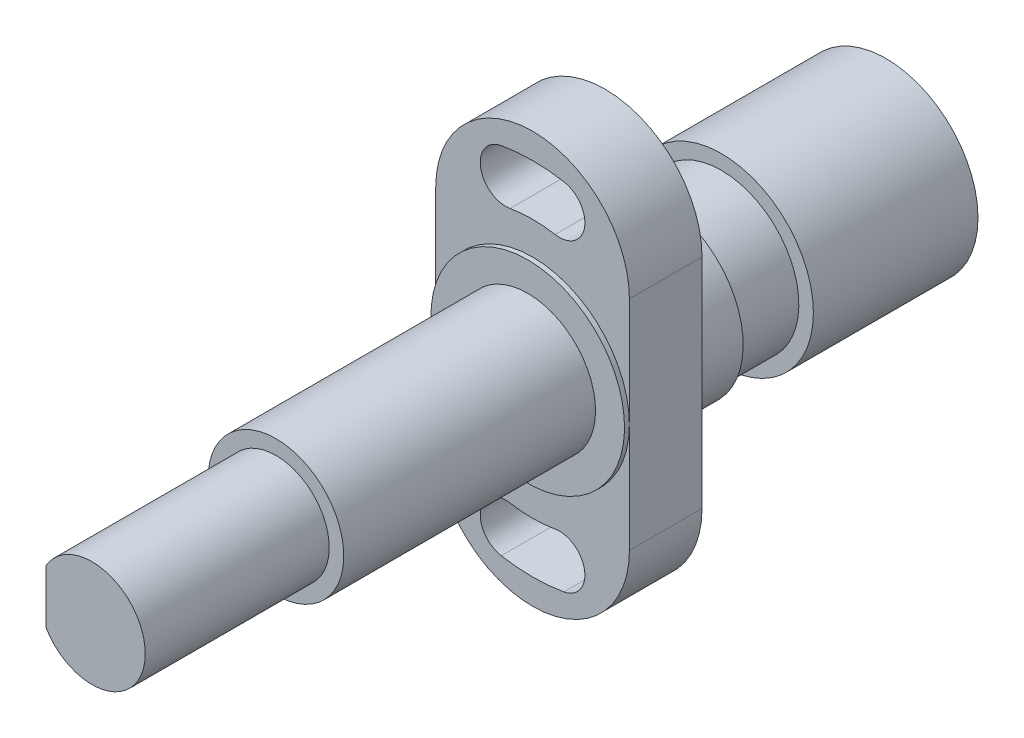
ISO-10303-21;
HEADER;
FILE_DESCRIPTION(('STEP AP214'),'2;1');
FILE_NAME('part.step','',(''),(''),'','','');
FILE_SCHEMA(('AUTOMOTIVE_DESIGN { 1 0 10303 214 1 1 1 1 }'));
ENDSEC;
DATA;
#1=APPLICATION_CONTEXT('core data for automotive mechanical design processes');
#2=APPLICATION_PROTOCOL_DEFINITION('international standard','automotive_design',2000,#1);
#3=PRODUCT_CONTEXT('',#1,'mechanical');
#4=PRODUCT('Part','Part','',(#3));
#5=PRODUCT_RELATED_PRODUCT_CATEGORY('part','',(#4));
#6=PRODUCT_DEFINITION_FORMATION('','',#4);
#7=PRODUCT_DEFINITION_CONTEXT('part definition',#1,'design');
#8=PRODUCT_DEFINITION('design','',#6,#7);
#9=PRODUCT_DEFINITION_SHAPE('','',#8);
#10=(LENGTH_UNIT() NAMED_UNIT(*) SI_UNIT(.MILLI.,.METRE.));
#11=(NAMED_UNIT(*) PLANE_ANGLE_UNIT() SI_UNIT($,.RADIAN.));
#12=(NAMED_UNIT(*) SI_UNIT($,.STERADIAN.) SOLID_ANGLE_UNIT());
#13=UNCERTAINTY_MEASURE_WITH_UNIT(LENGTH_MEASURE(1.E-05),#10,'distance_accuracy_value','');
#14=(GEOMETRIC_REPRESENTATION_CONTEXT(3) GLOBAL_UNCERTAINTY_ASSIGNED_CONTEXT((#13)) GLOBAL_UNIT_ASSIGNED_CONTEXT((#10,
#11,#12)) REPRESENTATION_CONTEXT('',''));
#15=CARTESIAN_POINT('',(0.,0.,0.));
#16=DIRECTION('',(0.,0.,1.));
#17=DIRECTION('',(1.,0.,0.));
#18=AXIS2_PLACEMENT_3D('',#15,#16,#17);
#19=CARTESIAN_POINT('',(-12.5,0.,-58.));
#20=DIRECTION('',(0.,0.,1.));
#21=DIRECTION('',(0.,1.,0.));
#22=AXIS2_PLACEMENT_3D('',#19,#20,#21);
#23=PLANE('',#22);
#24=CARTESIAN_POINT('',(0.,0.,-58.));
#25=DIRECTION('',(0.,0.,1.));
#26=DIRECTION('',(1.,0.,0.));
#27=AXIS2_PLACEMENT_3D('',#24,#25,#26);
#28=CIRCLE('',#27,15.9);
#29=CARTESIAN_POINT('',(15.9,0.,-58.));
#30=VERTEX_POINT('',#29);
#31=EDGE_CURVE('E9',#30,#30,#28,.F.);
#32=ORIENTED_EDGE('',*,*,#31,.F.);
#33=EDGE_LOOP('',(#32));
#34=FACE_BOUND('',#33,.T.);
#35=CARTESIAN_POINT('',(0.,0.,-58.));
#36=DIRECTION('',(0.,0.,1.));
#37=DIRECTION('',(1.,0.,0.));
#38=AXIS2_PLACEMENT_3D('',#35,#36,#37);
#39=CIRCLE('',#38,19.);
#40=CARTESIAN_POINT('',(19.,0.,-58.));
#41=VERTEX_POINT('',#40);
#42=EDGE_CURVE('E242',#41,#41,#39,.T.);
#43=ORIENTED_EDGE('',*,*,#42,.F.);
#44=EDGE_LOOP('',(#43));
#45=FACE_BOUND('',#44,.T.);
#46=ADVANCED_FACE('F15',(#34,#45),#23,.F.);
#47=CARTESIAN_POINT('',(-18.,0.,-49.));
#48=DIRECTION('',(-1.,0.,0.));
#49=DIRECTION('',(0.,-1.,0.));
#50=AXIS2_PLACEMENT_3D('',#47,#48,#49);
#51=CONICAL_SURFACE('',#50,2.9,0.785398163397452);
#52=CARTESIAN_POINT('',(-17.6,0.,-49.));
#53=DIRECTION('',(-1.,0.,0.));
#54=DIRECTION('',(0.,1.,0.));
#55=AXIS2_PLACEMENT_3D('',#52,#53,#54);
#56=CIRCLE('',#55,2.5);
#57=CARTESIAN_POINT('',(-17.6,2.5,-49.));
#58=VERTEX_POINT('',#57);
#59=EDGE_CURVE('E206',#58,#58,#56,.F.);
#60=ORIENTED_EDGE('',*,*,#59,.T.);
#61=EDGE_LOOP('',(#60));
#62=FACE_BOUND('',#61,.T.);
#63=CARTESIAN_POINT('',(-18.,0.,-49.));
#64=DIRECTION('',(-1.,0.,0.));
#65=DIRECTION('',(0.,-1.,0.));
#66=AXIS2_PLACEMENT_3D('',#63,#64,#65);
#67=CIRCLE('',#66,2.9);
#68=CARTESIAN_POINT('',(-18.,-2.9,-49.));
#69=VERTEX_POINT('',#68);
#70=EDGE_CURVE('E278',#69,#69,#67,.T.);
#71=ORIENTED_EDGE('',*,*,#70,.T.);
#72=EDGE_LOOP('',(#71));
#73=FACE_BOUND('',#72,.T.);
#74=ADVANCED_FACE('F326',(#62,#73),#51,.F.);
#75=CARTESIAN_POINT('',(-18.,0.,-31.));
#76=DIRECTION('',(-1.,0.,0.));
#77=DIRECTION('',(0.,-1.,0.));
#78=AXIS2_PLACEMENT_3D('',#75,#76,#77);
#79=CONICAL_SURFACE('',#78,2.9,0.78539816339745);
#80=CARTESIAN_POINT('',(-17.6,0.,-31.));
#81=DIRECTION('',(-1.,0.,0.));
#82=DIRECTION('',(0.,1.,0.));
#83=AXIS2_PLACEMENT_3D('',#80,#81,#82);
#84=CIRCLE('',#83,2.5);
#85=CARTESIAN_POINT('',(-17.6,2.5,-31.));
#86=VERTEX_POINT('',#85);
#87=EDGE_CURVE('E210',#86,#86,#84,.F.);
#88=ORIENTED_EDGE('',*,*,#87,.T.);
#89=EDGE_LOOP('',(#88));
#90=FACE_BOUND('',#89,.T.);
#91=CARTESIAN_POINT('',(-18.,0.,-31.));
#92=DIRECTION('',(-1.,0.,0.));
#93=DIRECTION('',(0.,-1.,0.));
#94=AXIS2_PLACEMENT_3D('',#91,#92,#93);
#95=CIRCLE('',#94,2.9);
#96=CARTESIAN_POINT('',(-18.,-2.9,-31.));
#97=VERTEX_POINT('',#96);
#98=EDGE_CURVE('E274',#97,#97,#95,.T.);
#99=ORIENTED_EDGE('',*,*,#98,.T.);
#100=EDGE_LOOP('',(#99));
#101=FACE_BOUND('',#100,.T.);
#102=ADVANCED_FACE('F329',(#90,#101),#79,.F.);
#103=CARTESIAN_POINT('',(0.,0.,-11.));
#104=DIRECTION('',(0.,0.,1.));
#105=DIRECTION('',(0.,1.,0.));
#106=AXIS2_PLACEMENT_3D('',#103,#104,#105);
#107=CYLINDRICAL_SURFACE('',#106,16.);
#108=CARTESIAN_POINT('',(0.,0.,-24.));
#109=DIRECTION('',(0.,0.,1.));
#110=DIRECTION('',(0.,1.,0.));
#111=AXIS2_PLACEMENT_3D('',#108,#109,#110);
#112=CIRCLE('',#111,16.);
#113=CARTESIAN_POINT('',(0.,16.,-24.));
#114=VERTEX_POINT('',#113);
#115=EDGE_CURVE('E262',#114,#114,#112,.T.);
#116=ORIENTED_EDGE('',*,*,#115,.T.);
#117=EDGE_LOOP('',(#116));
#118=FACE_BOUND('',#117,.T.);
#119=CARTESIAN_POINT('',(0.,0.,-11.));
#120=DIRECTION('',(0.,0.,1.));
#121=DIRECTION('',(1.,0.,0.));
#122=AXIS2_PLACEMENT_3D('',#119,#120,#121);
#123=CIRCLE('',#122,16.);
#124=CARTESIAN_POINT('',(16.,0.,-11.));
#125=VERTEX_POINT('',#124);
#126=EDGE_CURVE('E182',#125,#125,#123,.T.);
#127=ORIENTED_EDGE('',*,*,#126,.F.);
#128=EDGE_LOOP('',(#127));
#129=FACE_BOUND('',#128,.T.);
#130=ADVANCED_FACE('F333',(#118,#129),#107,.T.);
#131=CARTESIAN_POINT('',(0.,0.,-62.));
#132=DIRECTION('',(0.,0.,-1.));
#133=DIRECTION('',(-1.,0.,0.));
#134=AXIS2_PLACEMENT_3D('',#131,#132,#133);
#135=CONICAL_SURFACE('',#134,2.9,0.78539816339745);
#136=CARTESIAN_POINT('',(0.,0.,-61.6));
#137=DIRECTION('',(0.,0.,-1.));
#138=DIRECTION('',(-1.,0.,0.));
#139=AXIS2_PLACEMENT_3D('',#136,#137,#138);
#140=CIRCLE('',#139,2.5);
#141=CARTESIAN_POINT('',(-2.5,0.,-61.6));
#142=VERTEX_POINT('',#141);
#143=EDGE_CURVE('E19',#142,#142,#140,.F.);
#144=ORIENTED_EDGE('',*,*,#143,.T.);
#145=EDGE_LOOP('',(#144));
#146=FACE_BOUND('',#145,.T.);
#147=CARTESIAN_POINT('',(0.,0.,-62.));
#148=DIRECTION('',(0.,0.,-1.));
#149=DIRECTION('',(-1.,0.,0.));
#150=AXIS2_PLACEMENT_3D('',#147,#148,#149);
#151=CIRCLE('',#150,2.9);
#152=CARTESIAN_POINT('',(-2.9,0.,-62.));
#153=VERTEX_POINT('',#152);
#154=EDGE_CURVE('E263',#153,#153,#151,.T.);
#155=ORIENTED_EDGE('',*,*,#154,.T.);
#156=EDGE_LOOP('',(#155));
#157=FACE_BOUND('',#156,.T.);
#158=ADVANCED_FACE('F324',(#146,#157),#135,.F.);
#159=CARTESIAN_POINT('',(-18.,0.,-49.));
#160=DIRECTION('',(-1.,0.,0.));
#161=DIRECTION('',(0.,-1.,0.));
#162=AXIS2_PLACEMENT_3D('',#159,#160,#161);
#163=PLANE('',#162);
#164=ORIENTED_EDGE('',*,*,#70,.F.);
#165=EDGE_LOOP('',(#164));
#166=FACE_BOUND('',#165,.T.);
#167=CARTESIAN_POINT('',(-18.,0.,-49.));
#168=DIRECTION('',(-1.,0.,0.));
#169=DIRECTION('',(0.,-1.,0.));
#170=AXIS2_PLACEMENT_3D('',#167,#168,#169);
#171=CIRCLE('',#170,5.);
#172=CARTESIAN_POINT('',(-18.,-5.,-49.));
#173=VERTEX_POINT('',#172);
#174=EDGE_CURVE('E282',#173,#173,#171,.T.);
#175=ORIENTED_EDGE('',*,*,#174,.T.);
#176=EDGE_LOOP('',(#175));
#177=FACE_BOUND('',#176,.T.);
#178=ADVANCED_FACE('F315',(#166,#177),#163,.T.);
#179=CARTESIAN_POINT('',(-18.,0.,-31.));
#180=DIRECTION('',(-1.,0.,0.));
#181=DIRECTION('',(0.,-1.,0.));
#182=AXIS2_PLACEMENT_3D('',#179,#180,#181);
#183=PLANE('',#182);
#184=ORIENTED_EDGE('',*,*,#98,.F.);
#185=EDGE_LOOP('',(#184));
#186=FACE_BOUND('',#185,.T.);
#187=CARTESIAN_POINT('',(-18.,0.,-31.));
#188=DIRECTION('',(-1.,0.,0.));
#189=DIRECTION('',(0.,-1.,0.));
#190=AXIS2_PLACEMENT_3D('',#187,#188,#189);
#191=CIRCLE('',#190,5.);
#192=CARTESIAN_POINT('',(-18.,-5.,-31.));
#193=VERTEX_POINT('',#192);
#194=EDGE_CURVE('E286',#193,#193,#191,.T.);
#195=ORIENTED_EDGE('',*,*,#194,.T.);
#196=EDGE_LOOP('',(#195));
#197=FACE_BOUND('',#196,.T.);
#198=ADVANCED_FACE('F312',(#186,#197),#183,.T.);
#199=CARTESIAN_POINT('',(-19.,0.,-24.));
#200=DIRECTION('',(0.,0.,1.));
#201=DIRECTION('',(0.,1.,0.));
#202=AXIS2_PLACEMENT_3D('',#199,#200,#201);
#203=PLANE('',#202);
#204=ORIENTED_EDGE('',*,*,#115,.F.);
#205=EDGE_LOOP('',(#204));
#206=FACE_BOUND('',#205,.T.);
#207=CARTESIAN_POINT('',(0.,0.,-24.));
#208=DIRECTION('',(0.,0.,1.));
#209=DIRECTION('',(1.,0.,0.));
#210=AXIS2_PLACEMENT_3D('',#207,#208,#209);
#211=CIRCLE('',#210,19.);
#212=CARTESIAN_POINT('',(19.,0.,-24.));
#213=VERTEX_POINT('',#212);
#214=EDGE_CURVE('E238',#213,#213,#211,.T.);
#215=ORIENTED_EDGE('',*,*,#214,.T.);
#216=EDGE_LOOP('',(#215));
#217=FACE_BOUND('',#216,.T.);
#218=ADVANCED_FACE('F314',(#206,#217),#203,.T.);
#219=CARTESIAN_POINT('',(-12.5,0.,-62.));
#220=DIRECTION('',(0.,0.,1.));
#221=DIRECTION('',(1.,0.,0.));
#222=AXIS2_PLACEMENT_3D('',#219,#220,#221);
#223=PLANE('',#222);
#224=ORIENTED_EDGE('',*,*,#154,.F.);
#225=EDGE_LOOP('',(#224));
#226=FACE_BOUND('',#225,.T.);
#227=CARTESIAN_POINT('',(0.,0.,-62.));
#228=DIRECTION('',(0.,0.,1.));
#229=DIRECTION('',(1.,0.,0.));
#230=AXIS2_PLACEMENT_3D('',#227,#228,#229);
#231=CIRCLE('',#230,12.2);
#232=CARTESIAN_POINT('',(12.2,0.,-62.));
#233=VERTEX_POINT('',#232);
#234=EDGE_CURVE('E254',#233,#233,#231,.T.);
#235=ORIENTED_EDGE('',*,*,#234,.F.);
#236=EDGE_LOOP('',(#235));
#237=FACE_BOUND('',#236,.T.);
#238=ADVANCED_FACE('F320',(#226,#237),#223,.F.);
#239=CARTESIAN_POINT('',(-18.,0.,-49.));
#240=DIRECTION('',(-1.,0.,0.));
#241=DIRECTION('',(0.,-1.,0.));
#242=AXIS2_PLACEMENT_3D('',#239,#240,#241);
#243=CYLINDRICAL_SURFACE('',#242,5.);
#244=ORIENTED_EDGE('',*,*,#174,.F.);
#245=EDGE_LOOP('',(#244));
#246=FACE_BOUND('',#245,.T.);
#247=CARTESIAN_POINT('',(-18.3303027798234,-5.,-49.));
#248=CARTESIAN_POINT('',(-18.3303076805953,-4.99999308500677,-49.2755828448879));
#249=CARTESIAN_POINT('',(-18.3365854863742,-4.97713861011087,-49.5512395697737));
#250=CARTESIAN_POINT('',(-18.3609456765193,-4.88649188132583,-50.0946017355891));
#251=CARTESIAN_POINT('',(-18.3790341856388,-4.81867631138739,-50.3623029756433));
#252=CARTESIAN_POINT('',(-18.4248284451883,-4.64048304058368,-50.8818154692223));
#253=CARTESIAN_POINT('',(-18.4525209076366,-4.53016412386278,-51.1336481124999));
#254=CARTESIAN_POINT('',(-18.5143859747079,-4.27027879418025,-51.6152680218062));
#255=CARTESIAN_POINT('',(-18.5485590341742,-4.12070962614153,-51.845053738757));
#256=CARTESIAN_POINT('',(-18.6204675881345,-3.78267387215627,-52.281655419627));
#257=CARTESIAN_POINT('',(-18.6582649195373,-3.59342388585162,-52.4878547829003));
#258=CARTESIAN_POINT('',(-18.7326289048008,-3.1830839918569,-52.8659837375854));
#259=CARTESIAN_POINT('',(-18.7691954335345,-2.96199085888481,-53.0379098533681));
#260=CARTESIAN_POINT('',(-18.8376665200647,-2.48997619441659,-53.3451727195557));
#261=CARTESIAN_POINT('',(-18.8694896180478,-2.23864380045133,-53.4798980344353));
#262=CARTESIAN_POINT('',(-18.9241795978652,-1.71591903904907,-53.7049499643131));
#263=CARTESIAN_POINT('',(-18.9470479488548,-1.44452997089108,-53.7952838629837));
#264=CARTESIAN_POINT('',(-18.9808145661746,-0.895829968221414,-53.92699755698));
#265=CARTESIAN_POINT('',(-18.9919688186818,-0.618786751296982,-53.9694258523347));
#266=CARTESIAN_POINT('',(-19.0019448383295,-0.0613051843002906,-54.0074210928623));
#267=CARTESIAN_POINT('',(-19.0007686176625,0.219132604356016,-54.0029956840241));
#268=CARTESIAN_POINT('',(-18.9864044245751,0.768150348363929,-53.9481508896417));
#269=CARTESIAN_POINT('',(-18.9735122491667,1.03685236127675,-53.8988640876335));
#270=CARTESIAN_POINT('',(-18.9375127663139,1.56202860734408,-53.7575233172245));
#271=CARTESIAN_POINT('',(-18.9144048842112,1.81850215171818,-53.6654669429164));
#272=CARTESIAN_POINT('',(-18.8601287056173,2.31485231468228,-53.4403217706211));
#273=CARTESIAN_POINT('',(-18.8288840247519,2.55454275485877,-53.3068416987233));
#274=CARTESIAN_POINT('',(-18.7617056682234,3.00851095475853,-53.0029376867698));
#275=CARTESIAN_POINT('',(-18.7257710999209,3.22278386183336,-52.8325067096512));
#276=CARTESIAN_POINT('',(-18.651843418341,3.62659371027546,-52.4535136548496));
#277=CARTESIAN_POINT('',(-18.6138208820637,3.81519881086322,-52.2439633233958));
#278=CARTESIAN_POINT('',(-18.5409756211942,4.15481353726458,-51.7958134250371));
#279=CARTESIAN_POINT('',(-18.506153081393,4.30582099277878,-51.5572121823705));
#280=CARTESIAN_POINT('',(-18.4435351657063,4.56663864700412,-51.0557545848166));
#281=CARTESIAN_POINT('',(-18.4157822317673,4.67620185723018,-50.7927640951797));
#282=CARTESIAN_POINT('',(-18.3709765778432,4.84925751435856,-50.2511846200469));
#283=CARTESIAN_POINT('',(-18.3539212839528,4.91276104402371,-49.9725994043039));
#284=CARTESIAN_POINT('',(-18.3329885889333,4.99030134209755,-49.4164375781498));
#285=CARTESIAN_POINT('',(-18.3287417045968,5.00572550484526,-49.1390680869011));
#286=CARTESIAN_POINT('',(-18.3328968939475,4.99048654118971,-48.5857143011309));
#287=CARTESIAN_POINT('',(-18.3412976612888,4.95982817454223,-48.3097298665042));
#288=CARTESIAN_POINT('',(-18.3694453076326,4.85451613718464,-47.7722839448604));
#289=CARTESIAN_POINT('',(-18.3889783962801,4.78069079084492,-47.5106478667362));
#290=CARTESIAN_POINT('',(-18.4369822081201,4.59206897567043,-47.0034699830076));
#291=CARTESIAN_POINT('',(-18.4654540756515,4.4772672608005,-46.7579302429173));
#292=CARTESIAN_POINT('',(-18.5288899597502,4.20711613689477,-46.2840944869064));
#293=CARTESIAN_POINT('',(-18.5639802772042,4.05094882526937,-46.0562820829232));
#294=CARTESIAN_POINT('',(-18.6363994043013,3.70351772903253,-45.6295870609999));
#295=CARTESIAN_POINT('',(-18.6737286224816,3.51224752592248,-45.4307097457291));
#296=CARTESIAN_POINT('',(-18.7476872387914,3.09363353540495,-45.061801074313));
#297=CARTESIAN_POINT('',(-18.7842676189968,2.86542821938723,-44.892735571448));
#298=CARTESIAN_POINT('',(-18.8515301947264,2.38306898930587,-44.5953153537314));
#299=CARTESIAN_POINT('',(-18.8822127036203,2.12891645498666,-44.4669584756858));
#300=CARTESIAN_POINT('',(-18.9340252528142,1.60366333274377,-44.2557653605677));
#301=CARTESIAN_POINT('',(-18.9552259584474,1.33270586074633,-44.172591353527));
#302=CARTESIAN_POINT('',(-18.9859968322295,0.780020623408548,-44.0531369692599));
#303=CARTESIAN_POINT('',(-18.9955695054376,0.498295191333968,-44.016846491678));
#304=CARTESIAN_POINT('',(-19.0018908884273,-0.058894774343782,-43.9928082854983));
#305=CARTESIAN_POINT('',(-18.9990143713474,-0.334294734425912,-44.0036419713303));
#306=CARTESIAN_POINT('',(-18.9816045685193,-0.879206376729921,-44.0702603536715));
#307=CARTESIAN_POINT('',(-18.9670717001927,-1.14871826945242,-44.1260434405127));
#308=CARTESIAN_POINT('',(-18.9280530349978,-1.67254445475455,-44.2801836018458));
#309=CARTESIAN_POINT('',(-18.9036330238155,-1.92694669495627,-44.3782595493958));
#310=CARTESIAN_POINT('',(-18.8473973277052,-2.41582977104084,-44.6139497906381));
#311=CARTESIAN_POINT('',(-18.8155806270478,-2.650307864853,-44.7515695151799));
#312=CARTESIAN_POINT('',(-18.7469251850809,-3.0993177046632,-45.0666302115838));
#313=CARTESIAN_POINT('',(-18.7099770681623,-3.31316936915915,-45.2450165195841));
#314=CARTESIAN_POINT('',(-18.6356759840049,-3.70838303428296,-45.6347445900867));
#315=CARTESIAN_POINT('',(-18.5983229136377,-3.88973654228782,-45.8460949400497));
#316=CARTESIAN_POINT('',(-18.5265290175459,-4.21861622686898,-46.3011578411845));
#317=CARTESIAN_POINT('',(-18.4921669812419,-4.36534133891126,-46.5454628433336));
#318=CARTESIAN_POINT('',(-18.4313463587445,-4.61542491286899,-47.0561468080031));
#319=CARTESIAN_POINT('',(-18.4048824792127,-4.71881243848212,-47.3225108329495));
#320=CARTESIAN_POINT('',(-18.3666293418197,-4.86534794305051,-47.8233397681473));
#321=CARTESIAN_POINT('',(-18.3531154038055,-4.91572577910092,-48.0555828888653));
#322=CARTESIAN_POINT('',(-18.3349504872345,-4.98305299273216,-48.5251994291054));
#323=CARTESIAN_POINT('',(-18.3302985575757,-5.00000595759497,-48.7625722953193));
#324=CARTESIAN_POINT('',(-18.3303027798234,-5.,-49.));
#325=B_SPLINE_CURVE_WITH_KNOTS('',3,(#247,#248,#249,#250,#251,#252,#253,#254,#255,#256,#257,
#258,#259,#260,#261,#262,#263,#264,#265,#266,#267,#268,#269,#270,#271,#272,#273,#274,#275,#276,
#277,#278,#279,#280,#281,#282,#283,#284,#285,#286,#287,#288,#289,#290,#291,#292,#293,#294,#295,
#296,#297,#298,#299,#300,#301,#302,#303,#304,#305,#306,#307,#308,#309,#310,#311,#312,#313,#314,
#315,#316,#317,#318,#319,#320,#321,#322,#323,#324),.UNSPECIFIED.,.T.,.F.,(4,2,2,2,2,2,2,2,2,2,2,
2,2,2,2,2,2,2,2,2,2,2,2,2,2,2,2,2,2,2,2,2,2,2,2,2,2,2,4),(0.,0.825875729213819,1.65218007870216,
2.47734568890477,3.30256923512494,4.14594894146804,4.98941413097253,5.84601327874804,
6.70247183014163,7.53979807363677,8.37698767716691,9.19361043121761,10.010279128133,
10.834909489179,11.6596970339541,12.5091605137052,13.3586730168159,14.2131713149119,
15.0674639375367,15.896865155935,16.7261807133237,17.5400819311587,18.3540873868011,
19.1855755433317,20.0172158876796,20.8721888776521,21.7271164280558,22.5755616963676,
23.4238241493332,24.2467308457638,25.0696080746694,25.8870978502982,26.7046999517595,
27.5436351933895,28.3827893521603,29.2397824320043,30.0961998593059,30.8078073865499,
31.5193385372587),.UNSPECIFIED.);
#326=CARTESIAN_POINT('',(-18.3303027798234,-5.,-49.));
#327=VERTEX_POINT('',#326);
#328=EDGE_CURVE('E267',#327,#327,#325,.T.);
#329=ORIENTED_EDGE('',*,*,#328,.F.);
#330=EDGE_LOOP('',(#329));
#331=FACE_BOUND('',#330,.T.);
#332=ADVANCED_FACE('F310',(#246,#331),#243,.F.);
#333=CARTESIAN_POINT('',(-18.,0.,-31.));
#334=DIRECTION('',(-1.,0.,0.));
#335=DIRECTION('',(0.,-1.,0.));
#336=AXIS2_PLACEMENT_3D('',#333,#334,#335);
#337=CYLINDRICAL_SURFACE('',#336,5.);
#338=ORIENTED_EDGE('',*,*,#194,.F.);
#339=EDGE_LOOP('',(#338));
#340=FACE_BOUND('',#339,.T.);
#341=CARTESIAN_POINT('',(-18.3303027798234,-5.,-31.));
#342=CARTESIAN_POINT('',(-18.3303076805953,-4.99999308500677,-31.2755828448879));
#343=CARTESIAN_POINT('',(-18.3365854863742,-4.97713861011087,-31.5512395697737));
#344=CARTESIAN_POINT('',(-18.3609456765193,-4.88649188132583,-32.0946017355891));
#345=CARTESIAN_POINT('',(-18.3790341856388,-4.8186763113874,-32.3623029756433));
#346=CARTESIAN_POINT('',(-18.4248284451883,-4.64048304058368,-32.8818154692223));
#347=CARTESIAN_POINT('',(-18.4525209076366,-4.53016412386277,-33.1336481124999));
#348=CARTESIAN_POINT('',(-18.5143859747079,-4.27027879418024,-33.6152680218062));
#349=CARTESIAN_POINT('',(-18.5485590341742,-4.12070962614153,-33.845053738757));
#350=CARTESIAN_POINT('',(-18.6204675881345,-3.78267387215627,-34.2816554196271));
#351=CARTESIAN_POINT('',(-18.6582649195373,-3.59342388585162,-34.4878547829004));
#352=CARTESIAN_POINT('',(-18.7326289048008,-3.18308399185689,-34.8659837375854));
#353=CARTESIAN_POINT('',(-18.7691954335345,-2.9619908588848,-35.0379098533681));
#354=CARTESIAN_POINT('',(-18.8376665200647,-2.48997619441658,-35.3451727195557));
#355=CARTESIAN_POINT('',(-18.8694896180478,-2.23864380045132,-35.4798980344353));
#356=CARTESIAN_POINT('',(-18.9241795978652,-1.71591903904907,-35.7049499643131));
#357=CARTESIAN_POINT('',(-18.9470479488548,-1.44452997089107,-35.7952838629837));
#358=CARTESIAN_POINT('',(-18.9808145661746,-0.895829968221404,-35.92699755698));
#359=CARTESIAN_POINT('',(-18.9919688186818,-0.618786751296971,-35.9694258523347));
#360=CARTESIAN_POINT('',(-19.0019448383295,-0.0613051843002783,-36.0074210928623));
#361=CARTESIAN_POINT('',(-19.0007686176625,0.219132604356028,-36.0029956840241));
#362=CARTESIAN_POINT('',(-18.9864044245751,0.768150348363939,-35.9481508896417));
#363=CARTESIAN_POINT('',(-18.9735122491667,1.03685236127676,-35.8988640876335));
#364=CARTESIAN_POINT('',(-18.9375127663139,1.56202860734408,-35.7575233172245));
#365=CARTESIAN_POINT('',(-18.9144048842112,1.81850215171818,-35.6654669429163));
#366=CARTESIAN_POINT('',(-18.8601287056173,2.31485231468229,-35.4403217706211));
#367=CARTESIAN_POINT('',(-18.8288840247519,2.55454275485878,-35.3068416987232));
#368=CARTESIAN_POINT('',(-18.7617056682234,3.00851095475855,-35.0029376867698));
#369=CARTESIAN_POINT('',(-18.7257710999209,3.22278386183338,-34.8325067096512));
#370=CARTESIAN_POINT('',(-18.651843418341,3.62659371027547,-34.4535136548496));
#371=CARTESIAN_POINT('',(-18.6138208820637,3.81519881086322,-34.2439633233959));
#372=CARTESIAN_POINT('',(-18.5409756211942,4.15481353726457,-33.7958134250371));
#373=CARTESIAN_POINT('',(-18.506153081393,4.30582099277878,-33.5572121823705));
#374=CARTESIAN_POINT('',(-18.4435351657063,4.56663864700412,-33.0557545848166));
#375=CARTESIAN_POINT('',(-18.4157822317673,4.67620185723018,-32.7927640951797));
#376=CARTESIAN_POINT('',(-18.3709765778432,4.84925751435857,-32.2511846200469));
#377=CARTESIAN_POINT('',(-18.3539212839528,4.91276104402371,-31.9725994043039));
#378=CARTESIAN_POINT('',(-18.3329885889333,4.99030134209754,-31.4164375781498));
#379=CARTESIAN_POINT('',(-18.3287417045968,5.00572550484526,-31.1390680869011));
#380=CARTESIAN_POINT('',(-18.3328968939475,4.99048654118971,-30.5857143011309));
#381=CARTESIAN_POINT('',(-18.3412976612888,4.95982817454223,-30.3097298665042));
#382=CARTESIAN_POINT('',(-18.3694453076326,4.85451613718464,-29.7722839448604));
#383=CARTESIAN_POINT('',(-18.3889783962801,4.78069079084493,-29.5106478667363));
#384=CARTESIAN_POINT('',(-18.4369822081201,4.59206897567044,-29.0034699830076));
#385=CARTESIAN_POINT('',(-18.4654540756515,4.47726726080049,-28.7579302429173));
#386=CARTESIAN_POINT('',(-18.5288899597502,4.20711613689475,-28.2840944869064));
#387=CARTESIAN_POINT('',(-18.5639802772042,4.05094882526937,-28.0562820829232));
#388=CARTESIAN_POINT('',(-18.6363994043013,3.70351772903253,-27.6295870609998));
#389=CARTESIAN_POINT('',(-18.6737286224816,3.51224752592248,-27.430709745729));
#390=CARTESIAN_POINT('',(-18.7476872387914,3.09363353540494,-27.061801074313));
#391=CARTESIAN_POINT('',(-18.7842676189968,2.86542821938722,-26.892735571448));
#392=CARTESIAN_POINT('',(-18.8515301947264,2.38306898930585,-26.5953153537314));
#393=CARTESIAN_POINT('',(-18.8822127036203,2.12891645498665,-26.4669584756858));
#394=CARTESIAN_POINT('',(-18.9340252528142,1.60366333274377,-26.2557653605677));
#395=CARTESIAN_POINT('',(-18.9552259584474,1.33270586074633,-26.172591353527));
#396=CARTESIAN_POINT('',(-18.9859968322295,0.780020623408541,-26.0531369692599));
#397=CARTESIAN_POINT('',(-18.9955695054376,0.498295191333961,-26.016846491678));
#398=CARTESIAN_POINT('',(-19.0018908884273,-0.0588947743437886,-25.9928082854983));
#399=CARTESIAN_POINT('',(-18.9990143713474,-0.334294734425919,-26.0036419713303));
#400=CARTESIAN_POINT('',(-18.9816045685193,-0.879206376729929,-26.0702603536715));
#401=CARTESIAN_POINT('',(-18.9670717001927,-1.14871826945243,-26.1260434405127));
#402=CARTESIAN_POINT('',(-18.9280530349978,-1.67254445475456,-26.2801836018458));
#403=CARTESIAN_POINT('',(-18.9036330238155,-1.92694669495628,-26.3782595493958));
#404=CARTESIAN_POINT('',(-18.8473973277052,-2.41582977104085,-26.6139497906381));
#405=CARTESIAN_POINT('',(-18.8155806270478,-2.650307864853,-26.7515695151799));
#406=CARTESIAN_POINT('',(-18.7469251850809,-3.0993177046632,-27.0666302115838));
#407=CARTESIAN_POINT('',(-18.7099770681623,-3.31316936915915,-27.2450165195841));
#408=CARTESIAN_POINT('',(-18.6356759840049,-3.70838303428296,-27.6347445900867));
#409=CARTESIAN_POINT('',(-18.5983229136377,-3.88973654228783,-27.8460949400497));
#410=CARTESIAN_POINT('',(-18.5265290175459,-4.21861622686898,-28.3011578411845));
#411=CARTESIAN_POINT('',(-18.4921669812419,-4.36534133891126,-28.5454628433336));
#412=CARTESIAN_POINT('',(-18.4313463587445,-4.61542491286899,-29.0561468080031));
#413=CARTESIAN_POINT('',(-18.4048824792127,-4.71881243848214,-29.3225108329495));
#414=CARTESIAN_POINT('',(-18.3666293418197,-4.86534794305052,-29.8233397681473));
#415=CARTESIAN_POINT('',(-18.3531154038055,-4.91572577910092,-30.0555828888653));
#416=CARTESIAN_POINT('',(-18.3349504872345,-4.98305299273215,-30.5251994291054));
#417=CARTESIAN_POINT('',(-18.3302985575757,-5.00000595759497,-30.7625722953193));
#418=CARTESIAN_POINT('',(-18.3303027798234,-5.,-31.));
#419=B_SPLINE_CURVE_WITH_KNOTS('',3,(#341,#342,#343,#344,#345,#346,#347,#348,#349,#350,#351,
#352,#353,#354,#355,#356,#357,#358,#359,#360,#361,#362,#363,#364,#365,#366,#367,#368,#369,#370,
#371,#372,#373,#374,#375,#376,#377,#378,#379,#380,#381,#382,#383,#384,#385,#386,#387,#388,#389,
#390,#391,#392,#393,#394,#395,#396,#397,#398,#399,#400,#401,#402,#403,#404,#405,#406,#407,#408,
#409,#410,#411,#412,#413,#414,#415,#416,#417,#418),.UNSPECIFIED.,.T.,.F.,(4,2,2,2,2,2,2,2,2,2,2,
2,2,2,2,2,2,2,2,2,2,2,2,2,2,2,2,2,2,2,2,2,2,2,2,2,2,2,4),(0.,0.825875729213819,1.65218007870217,
2.47734568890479,3.30256923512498,4.14594894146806,4.98941413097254,5.84601327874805,
6.70247183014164,7.53979807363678,8.37698767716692,9.19361043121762,10.0102791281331,
10.8349094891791,11.6596970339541,12.5091605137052,13.3586730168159,14.2131713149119,
15.0674639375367,15.896865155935,16.7261807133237,17.5400819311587,18.354087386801,
19.1855755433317,20.0172158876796,20.8721888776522,21.7271164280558,22.5755616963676,
23.4238241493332,24.2467308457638,25.0696080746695,25.8870978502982,26.7046999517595,
27.5436351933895,28.3827893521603,29.2397824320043,30.0961998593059,30.8078073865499,
31.5193385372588),.UNSPECIFIED.);
#420=CARTESIAN_POINT('',(-18.3303027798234,-5.,-31.));
#421=VERTEX_POINT('',#420);
#422=EDGE_CURVE('E290',#421,#421,#419,.T.);
#423=ORIENTED_EDGE('',*,*,#422,.F.);
#424=EDGE_LOOP('',(#423));
#425=FACE_BOUND('',#424,.T.);
#426=ADVANCED_FACE('F306',(#340,#425),#337,.F.);
#427=CARTESIAN_POINT('',(0.,0.,-11.));
#428=DIRECTION('',(0.,0.,1.));
#429=DIRECTION('',(0.,1.,0.));
#430=AXIS2_PLACEMENT_3D('',#427,#428,#429);
#431=CYLINDRICAL_SURFACE('',#430,19.);
#432=ORIENTED_EDGE('',*,*,#422,.T.);
#433=EDGE_LOOP('',(#432));
#434=FACE_BOUND('',#433,.T.);
#435=ORIENTED_EDGE('',*,*,#328,.T.);
#436=EDGE_LOOP('',(#435));
#437=FACE_BOUND('',#436,.T.);
#438=ORIENTED_EDGE('',*,*,#42,.T.);
#439=EDGE_LOOP('',(#438));
#440=FACE_BOUND('',#439,.T.);
#441=ORIENTED_EDGE('',*,*,#214,.F.);
#442=EDGE_LOOP('',(#441));
#443=FACE_BOUND('',#442,.T.);
#444=ADVANCED_FACE('F303',(#434,#437,#440,#443),#431,.T.);
#445=CARTESIAN_POINT('',(0.,0.,-2.5));
#446=DIRECTION('',(0.,0.,-1.));
#447=DIRECTION('',(-1.,0.,0.));
#448=AXIS2_PLACEMENT_3D('',#445,#446,#447);
#449=CYLINDRICAL_SURFACE('',#448,12.2);
#450=CARTESIAN_POINT('',(0.,0.,-61.));
#451=DIRECTION('',(0.,0.,1.));
#452=DIRECTION('',(1.,0.,0.));
#453=AXIS2_PLACEMENT_3D('',#450,#451,#452);
#454=CIRCLE('',#453,12.2);
#455=CARTESIAN_POINT('',(12.2,0.,-61.));
#456=VERTEX_POINT('',#455);
#457=EDGE_CURVE('E246',#456,#456,#454,.T.);
#458=ORIENTED_EDGE('',*,*,#457,.F.);
#459=EDGE_LOOP('',(#458));
#460=FACE_BOUND('',#459,.T.);
#461=ORIENTED_EDGE('',*,*,#234,.T.);
#462=EDGE_LOOP('',(#461));
#463=FACE_BOUND('',#462,.T.);
#464=ADVANCED_FACE('F344',(#460,#463),#449,.T.);
#465=CARTESIAN_POINT('',(0.,0.,-2.5));
#466=DIRECTION('',(0.,0.,1.));
#467=DIRECTION('',(1.,0.,0.));
#468=AXIS2_PLACEMENT_3D('',#465,#466,#467);
#469=CYLINDRICAL_SURFACE('',#468,12.5);
#470=CARTESIAN_POINT('',(0.,0.,-59.5));
#471=DIRECTION('',(0.,0.,1.));
#472=DIRECTION('',(1.,0.,0.));
#473=AXIS2_PLACEMENT_3D('',#470,#471,#472);
#474=CIRCLE('',#473,12.5);
#475=CARTESIAN_POINT('',(12.5,0.,-59.5));
#476=VERTEX_POINT('',#475);
#477=EDGE_CURVE('E25',#476,#476,#474,.T.);
#478=ORIENTED_EDGE('',*,*,#477,.F.);
#479=EDGE_LOOP('',(#478));
#480=FACE_BOUND('',#479,.T.);
#481=CARTESIAN_POINT('',(0.,0.,-61.));
#482=DIRECTION('',(0.,0.,1.));
#483=DIRECTION('',(1.,0.,0.));
#484=AXIS2_PLACEMENT_3D('',#481,#482,#483);
#485=CIRCLE('',#484,12.5);
#486=CARTESIAN_POINT('',(12.5,0.,-61.));
#487=VERTEX_POINT('',#486);
#488=EDGE_CURVE('E250',#487,#487,#485,.T.);
#489=ORIENTED_EDGE('',*,*,#488,.T.);
#490=EDGE_LOOP('',(#489));
#491=FACE_BOUND('',#490,.T.);
#492=ADVANCED_FACE('F340',(#480,#491),#469,.T.);
#493=CARTESIAN_POINT('',(0.,0.,-59.5));
#494=DIRECTION('',(0.,0.,-1.));
#495=DIRECTION('',(-1.,0.,0.));
#496=AXIS2_PLACEMENT_3D('',#493,#494,#495);
#497=PLANE('',#496);
#498=CARTESIAN_POINT('',(0.,0.,-59.5));
#499=DIRECTION('',(0.,0.,-1.));
#500=DIRECTION('',(-1.,0.,0.));
#501=AXIS2_PLACEMENT_3D('',#498,#499,#500);
#502=CIRCLE('',#501,15.9);
#503=CARTESIAN_POINT('',(-15.9,0.,-59.5));
#504=VERTEX_POINT('',#503);
#505=EDGE_CURVE('E258',#504,#504,#502,.T.);
#506=ORIENTED_EDGE('',*,*,#505,.T.);
#507=EDGE_LOOP('',(#506));
#508=FACE_BOUND('',#507,.T.);
#509=ORIENTED_EDGE('',*,*,#477,.T.);
#510=EDGE_LOOP('',(#509));
#511=FACE_BOUND('',#510,.T.);
#512=ADVANCED_FACE('F343',(#508,#511),#497,.T.);
#513=CARTESIAN_POINT('',(0.,0.,-59.5));
#514=DIRECTION('',(0.,0.,1.));
#515=DIRECTION('',(1.,0.,0.));
#516=AXIS2_PLACEMENT_3D('',#513,#514,#515);
#517=CYLINDRICAL_SURFACE('',#516,15.9);
#518=ORIENTED_EDGE('',*,*,#505,.F.);
#519=EDGE_LOOP('',(#518));
#520=FACE_BOUND('',#519,.T.);
#521=ORIENTED_EDGE('',*,*,#31,.T.);
#522=EDGE_LOOP('',(#521));
#523=FACE_BOUND('',#522,.T.);
#524=ADVANCED_FACE('F355',(#520,#523),#517,.T.);
#525=CARTESIAN_POINT('',(12.2,0.,-61.));
#526=DIRECTION('',(0.,0.,-1.));
#527=DIRECTION('',(-1.,0.,0.));
#528=AXIS2_PLACEMENT_3D('',#525,#526,#527);
#529=PLANE('',#528);
#530=ORIENTED_EDGE('',*,*,#457,.T.);
#531=EDGE_LOOP('',(#530));
#532=FACE_BOUND('',#531,.T.);
#533=ORIENTED_EDGE('',*,*,#488,.F.);
#534=EDGE_LOOP('',(#533));
#535=FACE_BOUND('',#534,.T.);
#536=ADVANCED_FACE('F358',(#532,#535),#529,.T.);
#537=CARTESIAN_POINT('',(-9.5,0.,101.));
#538=DIRECTION('',(-1.,0.,0.));
#539=DIRECTION('',(0.,1.,0.));
#540=AXIS2_PLACEMENT_3D('',#537,#538,#539);
#541=CONICAL_SURFACE('',#540,2.65,0.785398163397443);
#542=CARTESIAN_POINT('',(-9.35,0.,101.));
#543=DIRECTION('',(-1.,0.,0.));
#544=DIRECTION('',(0.,0.,1.));
#545=AXIS2_PLACEMENT_3D('',#542,#543,#544);
#546=CIRCLE('',#545,2.5);
#547=CARTESIAN_POINT('',(-9.35,0.,103.5));
#548=VERTEX_POINT('',#547);
#549=EDGE_CURVE('E189',#548,#548,#546,.F.);
#550=ORIENTED_EDGE('',*,*,#549,.T.);
#551=EDGE_LOOP('',(#550));
#552=FACE_BOUND('',#551,.T.);
#553=CARTESIAN_POINT('',(-9.5,0.,101.));
#554=DIRECTION('',(1.,0.,0.));
#555=DIRECTION('',(0.,1.,0.));
#556=AXIS2_PLACEMENT_3D('',#553,#554,#555);
#557=CIRCLE('',#556,2.65);
#558=CARTESIAN_POINT('',(-9.5,2.65000000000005,101.));
#559=VERTEX_POINT('',#558);
#560=EDGE_CURVE('E567',#559,#559,#557,.T.);
#561=ORIENTED_EDGE('',*,*,#560,.F.);
#562=EDGE_LOOP('',(#561));
#563=FACE_BOUND('',#562,.T.);
#564=ADVANCED_FACE('F365',(#552,#563),#541,.F.);
#565=CARTESIAN_POINT('',(-9.5,10.,95.));
#566=DIRECTION('',(0.5,0.,-0.866025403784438));
#567=DIRECTION('',(-0.866025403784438,0.,-0.5));
#568=AXIS2_PLACEMENT_3D('',#565,#566,#567);
#569=PLANE('',#568);
#570=CARTESIAN_POINT('',(0.,0.,100.484827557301));
#571=DIRECTION('',(-0.5,0.,0.866025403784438));
#572=DIRECTION('',(-0.866025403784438,0.,-0.5));
#573=AXIS2_PLACEMENT_3D('',#570,#571,#572);
#574=ELLIPSE('',#573,12.7017059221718,11.);
#575=CARTESIAN_POINT('',(-9.5,5.54526825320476,95.));
#576=VERTEX_POINT('',#575);
#577=CARTESIAN_POINT('',(-9.5,-5.54526825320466,95.));
#578=VERTEX_POINT('',#577);
#579=EDGE_CURVE('E174',#576,#578,#574,.T.);
#580=ORIENTED_EDGE('',*,*,#579,.T.);
#581=DIRECTION('',(0.,-1.,0.));
#582=VECTOR('',#581,1.);
#583=CARTESIAN_POINT('',(-9.5,10.,95.));
#584=LINE('',#583,#582);
#585=EDGE_CURVE('E575',#576,#578,#584,.T.);
#586=ORIENTED_EDGE('',*,*,#585,.F.);
#587=EDGE_LOOP('',(#580,#586));
#588=FACE_BOUND('',#587,.T.);
#589=ADVANCED_FACE('F416',(#588),#569,.F.);
#590=CARTESIAN_POINT('',(0.,0.,106.));
#591=DIRECTION('',(0.,0.,1.));
#592=DIRECTION('',(0.,-1.,0.));
#593=AXIS2_PLACEMENT_3D('',#590,#591,#592);
#594=PLANE('',#593);
#595=DIRECTION('',(0.,1.,0.));
#596=VECTOR('',#595,1.);
#597=CARTESIAN_POINT('',(-9.5,5.54526825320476,106.));
#598=LINE('',#597,#596);
#599=CARTESIAN_POINT('',(-9.5,-5.54526825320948,106.));
#600=VERTEX_POINT('',#599);
#601=CARTESIAN_POINT('',(-9.5,5.54526825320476,106.));
#602=VERTEX_POINT('',#601);
#603=EDGE_CURVE('E553',#600,#602,#598,.T.);
#604=ORIENTED_EDGE('',*,*,#603,.F.);
#605=CARTESIAN_POINT('',(0.,0.,106.));
#606=DIRECTION('',(0.,0.,-1.));
#607=DIRECTION('',(1.,0.,0.));
#608=AXIS2_PLACEMENT_3D('',#605,#606,#607);
#609=CIRCLE('',#608,11.0000000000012);
#610=EDGE_CURVE('E547',#602,#600,#609,.T.);
#611=ORIENTED_EDGE('',*,*,#610,.F.);
#612=EDGE_LOOP('',(#604,#611));
#613=FACE_BOUND('',#612,.T.);
#614=ADVANCED_FACE('F423',(#613),#594,.T.);
#615=CARTESIAN_POINT('',(-9.5,10.,106.));
#616=DIRECTION('',(1.,0.,0.));
#617=DIRECTION('',(0.,0.,-1.));
#618=AXIS2_PLACEMENT_3D('',#615,#616,#617);
#619=PLANE('',#618);
#620=ORIENTED_EDGE('',*,*,#603,.T.);
#621=DIRECTION('',(0.,0.,-1.));
#622=VECTOR('',#621,1.);
#623=CARTESIAN_POINT('',(-9.5,5.54526825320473,0.));
#624=LINE('',#623,#622);
#625=EDGE_CURVE('E583',#602,#576,#624,.T.);
#626=ORIENTED_EDGE('',*,*,#625,.T.);
#627=ORIENTED_EDGE('',*,*,#585,.T.);
#628=DIRECTION('',(0.,0.,-1.));
#629=VECTOR('',#628,1.);
#630=CARTESIAN_POINT('',(-9.5,-5.54526825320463,0.));
#631=LINE('',#630,#629);
#632=EDGE_CURVE('E579',#578,#600,#631,.F.);
#633=ORIENTED_EDGE('',*,*,#632,.T.);
#634=EDGE_LOOP('',(#620,#626,#627,#633));
#635=FACE_BOUND('',#634,.T.);
#636=ORIENTED_EDGE('',*,*,#560,.T.);
#637=EDGE_LOOP('',(#636));
#638=FACE_BOUND('',#637,.T.);
#639=ADVANCED_FACE('F426',(#635,#638),#619,.F.);
#640=CARTESIAN_POINT('',(0.,0.,0.));
#641=DIRECTION('',(0.,0.,-1.));
#642=DIRECTION('',(0.,1.,0.));
#643=AXIS2_PLACEMENT_3D('',#640,#641,#642);
#644=CYLINDRICAL_SURFACE('',#643,11.);
#645=ORIENTED_EDGE('',*,*,#625,.F.);
#646=ORIENTED_EDGE('',*,*,#610,.T.);
#647=ORIENTED_EDGE('',*,*,#632,.F.);
#648=ORIENTED_EDGE('',*,*,#579,.F.);
#649=EDGE_LOOP('',(#645,#646,#647,#648));
#650=FACE_BOUND('',#649,.T.);
#651=CARTESIAN_POINT('',(0.,0.,68.));
#652=DIRECTION('',(0.,0.,1.));
#653=DIRECTION('',(0.,1.,0.));
#654=AXIS2_PLACEMENT_3D('',#651,#652,#653);
#655=CIRCLE('',#654,11.);
#656=CARTESIAN_POINT('',(0.,11.0000000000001,68.));
#657=VERTEX_POINT('',#656);
#658=EDGE_CURVE('E530',#657,#657,#655,.T.);
#659=ORIENTED_EDGE('',*,*,#658,.T.);
#660=EDGE_LOOP('',(#659));
#661=FACE_BOUND('',#660,.T.);
#662=ADVANCED_FACE('F439',(#650,#661),#644,.T.);
#663=CARTESIAN_POINT('',(-14.,0.,68.));
#664=DIRECTION('',(0.,0.,-1.));
#665=DIRECTION('',(0.,1.,0.));
#666=AXIS2_PLACEMENT_3D('',#663,#664,#665);
#667=PLANE('',#666);
#668=CARTESIAN_POINT('',(0.,0.,68.));
#669=DIRECTION('',(0.,0.,1.));
#670=DIRECTION('',(0.,1.,0.));
#671=AXIS2_PLACEMENT_3D('',#668,#669,#670);
#672=CIRCLE('',#671,14.);
#673=CARTESIAN_POINT('',(0.,14.0000000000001,68.));
#674=VERTEX_POINT('',#673);
#675=EDGE_CURVE('E514',#674,#674,#672,.T.);
#676=ORIENTED_EDGE('',*,*,#675,.T.);
#677=EDGE_LOOP('',(#676));
#678=FACE_BOUND('',#677,.T.);
#679=ORIENTED_EDGE('',*,*,#658,.F.);
#680=EDGE_LOOP('',(#679));
#681=FACE_BOUND('',#680,.T.);
#682=ADVANCED_FACE('F474',(#678,#681),#667,.F.);
#683=CARTESIAN_POINT('',(0.,0.,0.));
#684=DIRECTION('',(0.,0.,-1.));
#685=DIRECTION('',(0.,1.,0.));
#686=AXIS2_PLACEMENT_3D('',#683,#684,#685);
#687=CYLINDRICAL_SURFACE('',#686,14.);
#688=ORIENTED_EDGE('',*,*,#675,.F.);
#689=EDGE_LOOP('',(#688));
#690=FACE_BOUND('',#689,.T.);
#691=CARTESIAN_POINT('',(0.,0.,16.));
#692=DIRECTION('',(0.,0.,-1.));
#693=DIRECTION('',(0.,-1.,0.));
#694=AXIS2_PLACEMENT_3D('',#691,#692,#693);
#695=CIRCLE('',#694,14.);
#696=CARTESIAN_POINT('',(0.,-13.9999999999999,16.));
#697=VERTEX_POINT('',#696);
#698=EDGE_CURVE('E170',#697,#697,#695,.F.);
#699=ORIENTED_EDGE('',*,*,#698,.T.);
#700=EDGE_LOOP('',(#699));
#701=FACE_BOUND('',#700,.T.);
#702=ADVANCED_FACE('F478',(#690,#701),#687,.T.);
#703=CARTESIAN_POINT('',(-14.,0.,16.));
#704=DIRECTION('',(0.,0.,1.));
#705=DIRECTION('',(0.,-1.,0.));
#706=AXIS2_PLACEMENT_3D('',#703,#704,#705);
#707=PLANE('',#706);
#708=ORIENTED_EDGE('',*,*,#698,.F.);
#709=EDGE_LOOP('',(#708));
#710=FACE_BOUND('',#709,.T.);
#711=CARTESIAN_POINT('',(0.,0.,16.));
#712=DIRECTION('',(0.,0.,1.));
#713=DIRECTION('',(0.,1.,0.));
#714=AXIS2_PLACEMENT_3D('',#711,#712,#713);
#715=CIRCLE('',#714,19.995);
#716=CARTESIAN_POINT('',(0.,19.9950000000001,16.));
#717=VERTEX_POINT('',#716);
#718=EDGE_CURVE('E166',#717,#717,#715,.T.);
#719=ORIENTED_EDGE('',*,*,#718,.T.);
#720=EDGE_LOOP('',(#719));
#721=FACE_BOUND('',#720,.T.);
#722=ADVANCED_FACE('F499',(#710,#721),#707,.T.);
#723=CARTESIAN_POINT('',(0.,0.,0.));
#724=DIRECTION('',(0.,0.,-1.));
#725=DIRECTION('',(0.,1.,0.));
#726=AXIS2_PLACEMENT_3D('',#723,#724,#725);
#727=CYLINDRICAL_SURFACE('',#726,19.995);
#728=ORIENTED_EDGE('',*,*,#718,.F.);
#729=EDGE_LOOP('',(#728));
#730=FACE_BOUND('',#729,.T.);
#731=CARTESIAN_POINT('',(0.,0.,15.));
#732=DIRECTION('',(0.,0.,-1.));
#733=DIRECTION('',(0.,-1.,0.));
#734=AXIS2_PLACEMENT_3D('',#731,#732,#733);
#735=CIRCLE('',#734,19.995);
#736=CARTESIAN_POINT('',(0.,-19.9949999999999,15.));
#737=VERTEX_POINT('',#736);
#738=EDGE_CURVE('E521',#737,#737,#735,.T.);
#739=ORIENTED_EDGE('',*,*,#738,.F.);
#740=EDGE_LOOP('',(#739));
#741=FACE_BOUND('',#740,.T.);
#742=ADVANCED_FACE('F487',(#730,#741),#727,.T.);
#743=CARTESIAN_POINT('',(-20.,-13.,8.));
#744=DIRECTION('',(-1.,0.,0.));
#745=DIRECTION('',(0.,1.,0.));
#746=AXIS2_PLACEMENT_3D('',#743,#744,#745);
#747=CONICAL_SURFACE('',#746,2.65,0.78539816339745);
#748=CARTESIAN_POINT('',(-19.85,-13.,8.));
#749=DIRECTION('',(-1.,0.,0.));
#750=DIRECTION('',(0.,0.,1.));
#751=AXIS2_PLACEMENT_3D('',#748,#749,#750);
#752=CIRCLE('',#751,2.5);
#753=CARTESIAN_POINT('',(-19.85,-13.,10.5));
#754=VERTEX_POINT('',#753);
#755=EDGE_CURVE('E197',#754,#754,#752,.F.);
#756=ORIENTED_EDGE('',*,*,#755,.T.);
#757=EDGE_LOOP('',(#756));
#758=FACE_BOUND('',#757,.T.);
#759=CARTESIAN_POINT('',(-20.,-13.,8.));
#760=DIRECTION('',(1.,0.,0.));
#761=DIRECTION('',(0.,1.,0.));
#762=AXIS2_PLACEMENT_3D('',#759,#760,#761);
#763=CIRCLE('',#762,2.65);
#764=CARTESIAN_POINT('',(-20.,-10.35,8.));
#765=VERTEX_POINT('',#764);
#766=EDGE_CURVE('E557',#765,#765,#763,.T.);
#767=ORIENTED_EDGE('',*,*,#766,.F.);
#768=EDGE_LOOP('',(#767));
#769=FACE_BOUND('',#768,.T.);
#770=ADVANCED_FACE('F482',(#758,#769),#747,.F.);
#771=CARTESIAN_POINT('',(0.,-22.5,15.));
#772=DIRECTION('',(0.,0.,-1.));
#773=DIRECTION('',(0.,1.,0.));
#774=AXIS2_PLACEMENT_3D('',#771,#772,#773);
#775=PLANE('',#774);
#776=CARTESIAN_POINT('',(0.,0.,15.));
#777=DIRECTION('',(0.,0.,1.));
#778=DIRECTION('',(0.,-1.,0.));
#779=AXIS2_PLACEMENT_3D('',#776,#777,#778);
#780=CIRCLE('',#779,26.75);
#781=CARTESIAN_POINT('',(4.64508875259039,26.3436073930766,15.));
#782=VERTEX_POINT('',#781);
#783=CARTESIAN_POINT('',(-4.64508875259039,26.3436073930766,15.));
#784=VERTEX_POINT('',#783);
#785=EDGE_CURVE('E602',#782,#784,#780,.T.);
#786=ORIENTED_EDGE('',*,*,#785,.T.);
#787=CARTESIAN_POINT('',(-5.55674168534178,31.5138480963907,15.));
#788=DIRECTION('',(0.,0.,-1.));
#789=DIRECTION('',(0.,-1.,0.));
#790=AXIS2_PLACEMENT_3D('',#787,#788,#789);
#791=CIRCLE('',#790,5.25);
#792=CARTESIAN_POINT('',(-6.46839461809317,36.6840887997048,15.));
#793=VERTEX_POINT('',#792);
#794=EDGE_CURVE('E606',#784,#793,#791,.T.);
#795=ORIENTED_EDGE('',*,*,#794,.T.);
#796=CARTESIAN_POINT('',(0.,0.,15.));
#797=DIRECTION('',(0.,0.,-1.));
#798=DIRECTION('',(0.,-1.,0.));
#799=AXIS2_PLACEMENT_3D('',#796,#797,#798);
#800=CIRCLE('',#799,37.25);
#801=CARTESIAN_POINT('',(6.46839461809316,36.6840887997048,15.));
#802=VERTEX_POINT('',#801);
#803=EDGE_CURVE('E590',#793,#802,#800,.T.);
#804=ORIENTED_EDGE('',*,*,#803,.T.);
#805=CARTESIAN_POINT('',(5.55674168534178,31.5138480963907,15.));
#806=DIRECTION('',(0.,0.,-1.));
#807=DIRECTION('',(0.,1.,0.));
#808=AXIS2_PLACEMENT_3D('',#805,#806,#807);
#809=CIRCLE('',#808,5.25);
#810=EDGE_CURVE('E586',#802,#782,#809,.T.);
#811=ORIENTED_EDGE('',*,*,#810,.T.);
#812=EDGE_LOOP('',(#786,#795,#804,#811));
#813=FACE_BOUND('',#812,.T.);
#814=CARTESIAN_POINT('',(5.55674168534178,-31.5138480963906,15.));
#815=DIRECTION('',(0.,0.,-1.));
#816=DIRECTION('',(0.,-1.,0.));
#817=AXIS2_PLACEMENT_3D('',#814,#815,#816);
#818=CIRCLE('',#817,5.25);
#819=CARTESIAN_POINT('',(4.6450887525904,-26.3436073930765,15.));
#820=VERTEX_POINT('',#819);
#821=CARTESIAN_POINT('',(6.46839461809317,-36.6840887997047,15.));
#822=VERTEX_POINT('',#821);
#823=EDGE_CURVE('E643',#820,#822,#818,.T.);
#824=ORIENTED_EDGE('',*,*,#823,.T.);
#825=CARTESIAN_POINT('',(0.,0.,15.));
#826=DIRECTION('',(0.,0.,-1.));
#827=DIRECTION('',(0.,1.,0.));
#828=AXIS2_PLACEMENT_3D('',#825,#826,#827);
#829=CIRCLE('',#828,37.25);
#830=CARTESIAN_POINT('',(-6.46839461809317,-36.6840887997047,15.));
#831=VERTEX_POINT('',#830);
#832=EDGE_CURVE('E647',#822,#831,#829,.T.);
#833=ORIENTED_EDGE('',*,*,#832,.T.);
#834=CARTESIAN_POINT('',(-5.55674168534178,-31.5138480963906,15.));
#835=DIRECTION('',(0.,0.,-1.));
#836=DIRECTION('',(0.,1.,0.));
#837=AXIS2_PLACEMENT_3D('',#834,#835,#836);
#838=CIRCLE('',#837,5.25);
#839=CARTESIAN_POINT('',(-4.64508875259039,-26.3436073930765,15.));
#840=VERTEX_POINT('',#839);
#841=EDGE_CURVE('E629',#831,#840,#838,.T.);
#842=ORIENTED_EDGE('',*,*,#841,.T.);
#843=CARTESIAN_POINT('',(0.,0.,15.));
#844=DIRECTION('',(0.,0.,1.));
#845=DIRECTION('',(0.,1.,0.));
#846=AXIS2_PLACEMENT_3D('',#843,#844,#845);
#847=CIRCLE('',#846,26.75);
#848=EDGE_CURVE('E616',#840,#820,#847,.T.);
#849=ORIENTED_EDGE('',*,*,#848,.T.);
#850=EDGE_LOOP('',(#824,#833,#842,#849));
#851=FACE_BOUND('',#850,.T.);
#852=CARTESIAN_POINT('',(0.,-22.5,15.));
#853=DIRECTION('',(0.,0.,-1.));
#854=DIRECTION('',(0.,1.,0.));
#855=AXIS2_PLACEMENT_3D('',#852,#853,#854);
#856=CIRCLE('',#855,20.);
#857=CARTESIAN_POINT('',(20.,-22.5,15.));
#858=VERTEX_POINT('',#857);
#859=CARTESIAN_POINT('',(-20.,-22.5,15.));
#860=VERTEX_POINT('',#859);
#861=EDGE_CURVE('E524',#858,#860,#856,.T.);
#862=ORIENTED_EDGE('',*,*,#861,.F.);
#863=DIRECTION('',(0.,-1.,0.));
#864=VECTOR('',#863,1.);
#865=CARTESIAN_POINT('',(20.,22.5,15.));
#866=LINE('',#865,#864);
#867=CARTESIAN_POINT('',(20.,22.5,15.));
#868=VERTEX_POINT('',#867);
#869=EDGE_CURVE('E148',#868,#858,#866,.T.);
#870=ORIENTED_EDGE('',*,*,#869,.F.);
#871=CARTESIAN_POINT('',(0.,22.5,15.));
#872=DIRECTION('',(0.,0.,-1.));
#873=DIRECTION('',(0.,-1.,0.));
#874=AXIS2_PLACEMENT_3D('',#871,#872,#873);
#875=CIRCLE('',#874,20.);
#876=CARTESIAN_POINT('',(-20.,22.5,15.));
#877=VERTEX_POINT('',#876);
#878=EDGE_CURVE('E157',#877,#868,#875,.T.);
#879=ORIENTED_EDGE('',*,*,#878,.F.);
#880=DIRECTION('',(0.,1.,0.));
#881=VECTOR('',#880,1.);
#882=CARTESIAN_POINT('',(-20.,22.5,15.));
#883=LINE('',#882,#881);
#884=EDGE_CURVE('E528',#860,#877,#883,.T.);
#885=ORIENTED_EDGE('',*,*,#884,.F.);
#886=EDGE_LOOP('',(#862,#870,#879,#885));
#887=FACE_BOUND('',#886,.T.);
#888=ORIENTED_EDGE('',*,*,#738,.T.);
#889=EDGE_LOOP('',(#888));
#890=FACE_BOUND('',#889,.T.);
#891=ADVANCED_FACE('F461',(#813,#851,#887,#890),#775,.F.);
#892=CARTESIAN_POINT('',(20.,22.5,15.));
#893=DIRECTION('',(-1.,0.,0.));
#894=DIRECTION('',(0.,1.,0.));
#895=AXIS2_PLACEMENT_3D('',#892,#893,#894);
#896=PLANE('',#895);
#897=DIRECTION('',(0.,0.,-1.));
#898=VECTOR('',#897,1.);
#899=CARTESIAN_POINT('',(20.,22.5,15.));
#900=LINE('',#899,#898);
#901=CARTESIAN_POINT('',(20.,22.5,0.));
#902=VERTEX_POINT('',#901);
#903=EDGE_CURVE('E150',#868,#902,#900,.T.);
#904=ORIENTED_EDGE('',*,*,#903,.F.);
#905=ORIENTED_EDGE('',*,*,#869,.T.);
#906=DIRECTION('',(0.,0.,-1.));
#907=VECTOR('',#906,1.);
#908=CARTESIAN_POINT('',(20.,-22.5,15.));
#909=LINE('',#908,#907);
#910=CARTESIAN_POINT('',(20.,-22.5,0.));
#911=VERTEX_POINT('',#910);
#912=EDGE_CURVE('E129',#858,#911,#909,.T.);
#913=ORIENTED_EDGE('',*,*,#912,.T.);
#914=DIRECTION('',(0.,1.,0.));
#915=VECTOR('',#914,1.);
#916=CARTESIAN_POINT('',(20.,-22.5,0.));
#917=LINE('',#916,#915);
#918=EDGE_CURVE('E136',#911,#902,#917,.T.);
#919=ORIENTED_EDGE('',*,*,#918,.T.);
#920=EDGE_LOOP('',(#904,#905,#913,#919));
#921=FACE_BOUND('',#920,.T.);
#922=ADVANCED_FACE('F146',(#921),#896,.F.);
#923=CARTESIAN_POINT('',(0.,22.5,15.));
#924=DIRECTION('',(0.,0.,-1.));
#925=DIRECTION('',(0.,1.,0.));
#926=AXIS2_PLACEMENT_3D('',#923,#924,#925);
#927=CYLINDRICAL_SURFACE('',#926,20.);
#928=DIRECTION('',(0.,0.,-1.));
#929=VECTOR('',#928,1.);
#930=CARTESIAN_POINT('',(-20.,22.5,15.));
#931=LINE('',#930,#929);
#932=CARTESIAN_POINT('',(-20.,22.5,0.));
#933=VERTEX_POINT('',#932);
#934=EDGE_CURVE('E155',#877,#933,#931,.T.);
#935=ORIENTED_EDGE('',*,*,#934,.F.);
#936=ORIENTED_EDGE('',*,*,#878,.T.);
#937=ORIENTED_EDGE('',*,*,#903,.T.);
#938=CARTESIAN_POINT('',(0.,22.5,0.));
#939=DIRECTION('',(0.,0.,1.));
#940=DIRECTION('',(-1.,0.,0.));
#941=AXIS2_PLACEMENT_3D('',#938,#939,#940);
#942=CIRCLE('',#941,20.);
#943=EDGE_CURVE('E140',#902,#933,#942,.T.);
#944=ORIENTED_EDGE('',*,*,#943,.T.);
#945=EDGE_LOOP('',(#935,#936,#937,#944));
#946=FACE_BOUND('',#945,.T.);
#947=ADVANCED_FACE('F484',(#946),#927,.T.);
#948=CARTESIAN_POINT('',(-20.,22.5,15.));
#949=DIRECTION('',(1.,0.,0.));
#950=DIRECTION('',(0.,-1.,0.));
#951=AXIS2_PLACEMENT_3D('',#948,#949,#950);
#952=PLANE('',#951);
#953=ORIENTED_EDGE('',*,*,#766,.T.);
#954=EDGE_LOOP('',(#953));
#955=FACE_BOUND('',#954,.T.);
#956=DIRECTION('',(0.,0.,-1.));
#957=VECTOR('',#956,1.);
#958=CARTESIAN_POINT('',(-20.,-22.5,15.));
#959=LINE('',#958,#957);
#960=CARTESIAN_POINT('',(-20.,-22.5,0.));
#961=VERTEX_POINT('',#960);
#962=EDGE_CURVE('E132',#860,#961,#959,.T.);
#963=ORIENTED_EDGE('',*,*,#962,.F.);
#964=ORIENTED_EDGE('',*,*,#884,.T.);
#965=ORIENTED_EDGE('',*,*,#934,.T.);
#966=DIRECTION('',(0.,-1.,0.));
#967=VECTOR('',#966,1.);
#968=CARTESIAN_POINT('',(-20.,22.5,0.));
#969=LINE('',#968,#967);
#970=EDGE_CURVE('E540',#933,#961,#969,.T.);
#971=ORIENTED_EDGE('',*,*,#970,.T.);
#972=EDGE_LOOP('',(#963,#964,#965,#971));
#973=FACE_BOUND('',#972,.T.);
#974=ADVANCED_FACE('F490',(#955,#973),#952,.F.);
#975=CARTESIAN_POINT('',(0.,-22.5,15.));
#976=DIRECTION('',(0.,0.,-1.));
#977=DIRECTION('',(0.,1.,0.));
#978=AXIS2_PLACEMENT_3D('',#975,#976,#977);
#979=CYLINDRICAL_SURFACE('',#978,20.);
#980=ORIENTED_EDGE('',*,*,#912,.F.);
#981=ORIENTED_EDGE('',*,*,#861,.T.);
#982=ORIENTED_EDGE('',*,*,#962,.T.);
#983=CARTESIAN_POINT('',(0.,-22.5,0.));
#984=DIRECTION('',(0.,0.,1.));
#985=DIRECTION('',(-1.,0.,0.));
#986=AXIS2_PLACEMENT_3D('',#983,#984,#985);
#987=CIRCLE('',#986,20.);
#988=EDGE_CURVE('E124',#961,#911,#987,.T.);
#989=ORIENTED_EDGE('',*,*,#988,.T.);
#990=EDGE_LOOP('',(#980,#981,#982,#989));
#991=FACE_BOUND('',#990,.T.);
#992=ADVANCED_FACE('F126',(#991),#979,.T.);
#993=CARTESIAN_POINT('',(5.55674168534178,-31.5138480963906,0.));
#994=DIRECTION('',(0.,0.,1.));
#995=DIRECTION('',(0.,-1.,0.));
#996=AXIS2_PLACEMENT_3D('',#993,#994,#995);
#997=CYLINDRICAL_SURFACE('',#996,5.25);
#998=DIRECTION('',(0.,0.,1.));
#999=VECTOR('',#998,1.);
#1000=CARTESIAN_POINT('',(4.6450887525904,-26.3436073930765,0.));
#1001=LINE('',#1000,#999);
#1002=CARTESIAN_POINT('',(4.6450887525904,-26.3436073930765,0.));
#1003=VERTEX_POINT('',#1002);
#1004=EDGE_CURVE('E639',#1003,#820,#1001,.T.);
#1005=ORIENTED_EDGE('',*,*,#1004,.F.);
#1006=CARTESIAN_POINT('',(5.55674168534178,-31.5138480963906,0.));
#1007=DIRECTION('',(0.,0.,-1.));
#1008=DIRECTION('',(0.,-1.,0.));
#1009=AXIS2_PLACEMENT_3D('',#1006,#1007,#1008);
#1010=CIRCLE('',#1009,5.25);
#1011=CARTESIAN_POINT('',(6.46839461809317,-36.6840887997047,0.));
#1012=VERTEX_POINT('',#1011);
#1013=EDGE_CURVE('E628',#1003,#1012,#1010,.T.);
#1014=ORIENTED_EDGE('',*,*,#1013,.T.);
#1015=DIRECTION('',(0.,0.,1.));
#1016=VECTOR('',#1015,1.);
#1017=CARTESIAN_POINT('',(6.46839461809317,-36.6840887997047,0.));
#1018=LINE('',#1017,#1016);
#1019=EDGE_CURVE('E660',#1012,#822,#1018,.T.);
#1020=ORIENTED_EDGE('',*,*,#1019,.T.);
#1021=ORIENTED_EDGE('',*,*,#823,.F.);
#1022=EDGE_LOOP('',(#1005,#1014,#1020,#1021));
#1023=FACE_BOUND('',#1022,.T.);
#1024=ADVANCED_FACE('F464',(#1023),#997,.F.);
#1025=CARTESIAN_POINT('',(0.,0.,0.));
#1026=DIRECTION('',(0.,0.,1.));
#1027=DIRECTION('',(0.,-1.,0.));
#1028=AXIS2_PLACEMENT_3D('',#1025,#1026,#1027);
#1029=CYLINDRICAL_SURFACE('',#1028,37.25);
#1030=ORIENTED_EDGE('',*,*,#1019,.F.);
#1031=CARTESIAN_POINT('',(0.,0.,0.));
#1032=DIRECTION('',(0.,0.,-1.));
#1033=DIRECTION('',(0.,1.,0.));
#1034=AXIS2_PLACEMENT_3D('',#1031,#1032,#1033);
#1035=CIRCLE('',#1034,37.25);
#1036=CARTESIAN_POINT('',(-6.46839461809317,-36.6840887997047,0.));
#1037=VERTEX_POINT('',#1036);
#1038=EDGE_CURVE('E632',#1012,#1037,#1035,.T.);
#1039=ORIENTED_EDGE('',*,*,#1038,.T.);
#1040=DIRECTION('',(0.,0.,1.));
#1041=VECTOR('',#1040,1.);
#1042=CARTESIAN_POINT('',(-6.46839461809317,-36.6840887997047,0.));
#1043=LINE('',#1042,#1041);
#1044=EDGE_CURVE('E657',#1037,#831,#1043,.T.);
#1045=ORIENTED_EDGE('',*,*,#1044,.T.);
#1046=ORIENTED_EDGE('',*,*,#832,.F.);
#1047=EDGE_LOOP('',(#1030,#1039,#1045,#1046));
#1048=FACE_BOUND('',#1047,.T.);
#1049=ADVANCED_FACE('F459',(#1048),#1029,.F.);
#1050=CARTESIAN_POINT('',(-5.55674168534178,-31.5138480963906,0.));
#1051=DIRECTION('',(0.,0.,1.));
#1052=DIRECTION('',(0.,-1.,0.));
#1053=AXIS2_PLACEMENT_3D('',#1050,#1051,#1052);
#1054=CYLINDRICAL_SURFACE('',#1053,5.25);
#1055=ORIENTED_EDGE('',*,*,#1044,.F.);
#1056=CARTESIAN_POINT('',(-5.55674168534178,-31.5138480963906,0.));
#1057=DIRECTION('',(0.,0.,-1.));
#1058=DIRECTION('',(0.,1.,0.));
#1059=AXIS2_PLACEMENT_3D('',#1056,#1057,#1058);
#1060=CIRCLE('',#1059,5.25);
#1061=CARTESIAN_POINT('',(-4.64508875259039,-26.3436073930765,0.));
#1062=VERTEX_POINT('',#1061);
#1063=EDGE_CURVE('E635',#1037,#1062,#1060,.T.);
#1064=ORIENTED_EDGE('',*,*,#1063,.T.);
#1065=DIRECTION('',(0.,0.,1.));
#1066=VECTOR('',#1065,1.);
#1067=CARTESIAN_POINT('',(-4.64508875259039,-26.3436073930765,0.));
#1068=LINE('',#1067,#1066);
#1069=EDGE_CURVE('E654',#1062,#840,#1068,.T.);
#1070=ORIENTED_EDGE('',*,*,#1069,.T.);
#1071=ORIENTED_EDGE('',*,*,#841,.F.);
#1072=EDGE_LOOP('',(#1055,#1064,#1070,#1071));
#1073=FACE_BOUND('',#1072,.T.);
#1074=ADVANCED_FACE('F456',(#1073),#1054,.F.);
#1075=CARTESIAN_POINT('',(0.,0.,0.));
#1076=DIRECTION('',(0.,0.,1.));
#1077=DIRECTION('',(0.,-1.,0.));
#1078=AXIS2_PLACEMENT_3D('',#1075,#1076,#1077);
#1079=CYLINDRICAL_SURFACE('',#1078,26.75);
#1080=ORIENTED_EDGE('',*,*,#1069,.F.);
#1081=CARTESIAN_POINT('',(0.,0.,0.));
#1082=DIRECTION('',(0.,0.,1.));
#1083=DIRECTION('',(0.,1.,0.));
#1084=AXIS2_PLACEMENT_3D('',#1081,#1082,#1083);
#1085=CIRCLE('',#1084,26.75);
#1086=EDGE_CURVE('E625',#1062,#1003,#1085,.T.);
#1087=ORIENTED_EDGE('',*,*,#1086,.T.);
#1088=ORIENTED_EDGE('',*,*,#1004,.T.);
#1089=ORIENTED_EDGE('',*,*,#848,.F.);
#1090=EDGE_LOOP('',(#1080,#1087,#1088,#1089));
#1091=FACE_BOUND('',#1090,.T.);
#1092=ADVANCED_FACE('F447',(#1091),#1079,.T.);
#1093=CARTESIAN_POINT('',(0.,0.,0.));
#1094=DIRECTION('',(0.,0.,1.));
#1095=DIRECTION('',(0.,-1.,0.));
#1096=AXIS2_PLACEMENT_3D('',#1093,#1094,#1095);
#1097=CYLINDRICAL_SURFACE('',#1096,26.75);
#1098=DIRECTION('',(0.,0.,1.));
#1099=VECTOR('',#1098,1.);
#1100=CARTESIAN_POINT('',(4.64508875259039,26.3436073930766,0.));
#1101=LINE('',#1100,#1099);
#1102=CARTESIAN_POINT('',(4.64508875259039,26.3436073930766,0.));
#1103=VERTEX_POINT('',#1102);
#1104=EDGE_CURVE('E40',#1103,#782,#1101,.T.);
#1105=ORIENTED_EDGE('',*,*,#1104,.F.);
#1106=CARTESIAN_POINT('',(0.,0.,0.));
#1107=DIRECTION('',(0.,0.,1.));
#1108=DIRECTION('',(0.,-1.,0.));
#1109=AXIS2_PLACEMENT_3D('',#1106,#1107,#1108);
#1110=CIRCLE('',#1109,26.75);
#1111=CARTESIAN_POINT('',(-4.64508875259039,26.3436073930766,0.));
#1112=VERTEX_POINT('',#1111);
#1113=EDGE_CURVE('E33',#1103,#1112,#1110,.T.);
#1114=ORIENTED_EDGE('',*,*,#1113,.T.);
#1115=DIRECTION('',(0.,0.,1.));
#1116=VECTOR('',#1115,1.);
#1117=CARTESIAN_POINT('',(-4.64508875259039,26.3436073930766,0.));
#1118=LINE('',#1117,#1116);
#1119=EDGE_CURVE('E620',#1112,#784,#1118,.T.);
#1120=ORIENTED_EDGE('',*,*,#1119,.T.);
#1121=ORIENTED_EDGE('',*,*,#785,.F.);
#1122=EDGE_LOOP('',(#1105,#1114,#1120,#1121));
#1123=FACE_BOUND('',#1122,.T.);
#1124=ADVANCED_FACE('F450',(#1123),#1097,.T.);
#1125=CARTESIAN_POINT('',(-5.55674168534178,31.5138480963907,0.));
#1126=DIRECTION('',(0.,0.,1.));
#1127=DIRECTION('',(0.,-1.,0.));
#1128=AXIS2_PLACEMENT_3D('',#1125,#1126,#1127);
#1129=CYLINDRICAL_SURFACE('',#1128,5.25);
#1130=ORIENTED_EDGE('',*,*,#1119,.F.);
#1131=CARTESIAN_POINT('',(-5.55674168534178,31.5138480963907,0.));
#1132=DIRECTION('',(0.,0.,-1.));
#1133=DIRECTION('',(0.,-1.,0.));
#1134=AXIS2_PLACEMENT_3D('',#1131,#1132,#1133);
#1135=CIRCLE('',#1134,5.25);
#1136=CARTESIAN_POINT('',(-6.46839461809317,36.6840887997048,0.));
#1137=VERTEX_POINT('',#1136);
#1138=EDGE_CURVE('E593',#1112,#1137,#1135,.T.);
#1139=ORIENTED_EDGE('',*,*,#1138,.T.);
#1140=DIRECTION('',(0.,0.,1.));
#1141=VECTOR('',#1140,1.);
#1142=CARTESIAN_POINT('',(-6.46839461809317,36.6840887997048,0.));
#1143=LINE('',#1142,#1141);
#1144=EDGE_CURVE('E617',#1137,#793,#1143,.T.);
#1145=ORIENTED_EDGE('',*,*,#1144,.T.);
#1146=ORIENTED_EDGE('',*,*,#794,.F.);
#1147=EDGE_LOOP('',(#1130,#1139,#1145,#1146));
#1148=FACE_BOUND('',#1147,.T.);
#1149=ADVANCED_FACE('F445',(#1148),#1129,.F.);
#1150=CARTESIAN_POINT('',(0.,0.,0.));
#1151=DIRECTION('',(0.,0.,1.));
#1152=DIRECTION('',(0.,-1.,0.));
#1153=AXIS2_PLACEMENT_3D('',#1150,#1151,#1152);
#1154=CYLINDRICAL_SURFACE('',#1153,37.25);
#1155=ORIENTED_EDGE('',*,*,#1144,.F.);
#1156=CARTESIAN_POINT('',(0.,0.,0.));
#1157=DIRECTION('',(0.,0.,-1.));
#1158=DIRECTION('',(0.,-1.,0.));
#1159=AXIS2_PLACEMENT_3D('',#1156,#1157,#1158);
#1160=CIRCLE('',#1159,37.25);
#1161=CARTESIAN_POINT('',(6.46839461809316,36.6840887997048,0.));
#1162=VERTEX_POINT('',#1161);
#1163=EDGE_CURVE('E596',#1137,#1162,#1160,.T.);
#1164=ORIENTED_EDGE('',*,*,#1163,.T.);
#1165=DIRECTION('',(0.,0.,1.));
#1166=VECTOR('',#1165,1.);
#1167=CARTESIAN_POINT('',(6.46839461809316,36.6840887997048,0.));
#1168=LINE('',#1167,#1166);
#1169=EDGE_CURVE('E613',#1162,#802,#1168,.T.);
#1170=ORIENTED_EDGE('',*,*,#1169,.T.);
#1171=ORIENTED_EDGE('',*,*,#803,.F.);
#1172=EDGE_LOOP('',(#1155,#1164,#1170,#1171));
#1173=FACE_BOUND('',#1172,.T.);
#1174=ADVANCED_FACE('F441',(#1173),#1154,.F.);
#1175=CARTESIAN_POINT('',(5.55674168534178,31.5138480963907,0.));
#1176=DIRECTION('',(0.,0.,1.));
#1177=DIRECTION('',(0.,-1.,0.));
#1178=AXIS2_PLACEMENT_3D('',#1175,#1176,#1177);
#1179=CYLINDRICAL_SURFACE('',#1178,5.25);
#1180=ORIENTED_EDGE('',*,*,#1169,.F.);
#1181=CARTESIAN_POINT('',(5.55674168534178,31.5138480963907,0.));
#1182=DIRECTION('',(0.,0.,-1.));
#1183=DIRECTION('',(0.,1.,0.));
#1184=AXIS2_PLACEMENT_3D('',#1181,#1182,#1183);
#1185=CIRCLE('',#1184,5.25);
#1186=EDGE_CURVE('E587',#1162,#1103,#1185,.T.);
#1187=ORIENTED_EDGE('',*,*,#1186,.T.);
#1188=ORIENTED_EDGE('',*,*,#1104,.T.);
#1189=ORIENTED_EDGE('',*,*,#810,.F.);
#1190=EDGE_LOOP('',(#1180,#1187,#1188,#1189));
#1191=FACE_BOUND('',#1190,.T.);
#1192=ADVANCED_FACE('F444',(#1191),#1179,.F.);
#1193=CARTESIAN_POINT('',(-10.,0.,0.));
#1194=DIRECTION('',(0.,0.,-1.));
#1195=DIRECTION('',(0.,1.,0.));
#1196=AXIS2_PLACEMENT_3D('',#1193,#1194,#1195);
#1197=PLANE('',#1196);
#1198=CARTESIAN_POINT('',(0.,0.,0.));
#1199=DIRECTION('',(0.,0.,1.));
#1200=DIRECTION('',(0.,1.,0.));
#1201=AXIS2_PLACEMENT_3D('',#1198,#1199,#1200);
#1202=CIRCLE('',#1201,17.5);
#1203=CARTESIAN_POINT('',(0.,17.5000000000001,0.));
#1204=VERTEX_POINT('',#1203);
#1205=EDGE_CURVE('E178',#1204,#1204,#1202,.T.);
#1206=ORIENTED_EDGE('',*,*,#1205,.T.);
#1207=EDGE_LOOP('',(#1206));
#1208=FACE_BOUND('',#1207,.T.);
#1209=ORIENTED_EDGE('',*,*,#1186,.F.);
#1210=ORIENTED_EDGE('',*,*,#1163,.F.);
#1211=ORIENTED_EDGE('',*,*,#1138,.F.);
#1212=ORIENTED_EDGE('',*,*,#1113,.F.);
#1213=EDGE_LOOP('',(#1209,#1210,#1211,#1212));
#1214=FACE_BOUND('',#1213,.T.);
#1215=ORIENTED_EDGE('',*,*,#1086,.F.);
#1216=ORIENTED_EDGE('',*,*,#1063,.F.);
#1217=ORIENTED_EDGE('',*,*,#1038,.F.);
#1218=ORIENTED_EDGE('',*,*,#1013,.F.);
#1219=EDGE_LOOP('',(#1215,#1216,#1217,#1218));
#1220=FACE_BOUND('',#1219,.T.);
#1221=ORIENTED_EDGE('',*,*,#988,.F.);
#1222=ORIENTED_EDGE('',*,*,#970,.F.);
#1223=ORIENTED_EDGE('',*,*,#943,.F.);
#1224=ORIENTED_EDGE('',*,*,#918,.F.);
#1225=EDGE_LOOP('',(#1221,#1222,#1223,#1224));
#1226=FACE_BOUND('',#1225,.T.);
#1227=ADVANCED_FACE('F17',(#1208,#1214,#1220,#1226),#1197,.T.);
#1228=CARTESIAN_POINT('',(0.,0.,0.));
#1229=DIRECTION('',(0.,0.,-1.));
#1230=DIRECTION('',(0.,1.,0.));
#1231=AXIS2_PLACEMENT_3D('',#1228,#1229,#1230);
#1232=CYLINDRICAL_SURFACE('',#1231,17.5);
#1233=ORIENTED_EDGE('',*,*,#1205,.F.);
#1234=EDGE_LOOP('',(#1233));
#1235=FACE_BOUND('',#1234,.T.);
#1236=CARTESIAN_POINT('',(0.,0.,-11.));
#1237=DIRECTION('',(0.,0.,1.));
#1238=DIRECTION('',(0.,1.,0.));
#1239=AXIS2_PLACEMENT_3D('',#1236,#1237,#1238);
#1240=CIRCLE('',#1239,17.5);
#1241=CARTESIAN_POINT('',(0.,17.5000000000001,-11.));
#1242=VERTEX_POINT('',#1241);
#1243=EDGE_CURVE('E187',#1242,#1242,#1240,.T.);
#1244=ORIENTED_EDGE('',*,*,#1243,.T.);
#1245=EDGE_LOOP('',(#1244));
#1246=FACE_BOUND('',#1245,.T.);
#1247=ADVANCED_FACE('F685',(#1235,#1246),#1232,.T.);
#1248=CARTESIAN_POINT('',(-10.,0.,-11.));
#1249=DIRECTION('',(0.,0.,-1.));
#1250=DIRECTION('',(0.,1.,0.));
#1251=AXIS2_PLACEMENT_3D('',#1248,#1249,#1250);
#1252=PLANE('',#1251);
#1253=ORIENTED_EDGE('',*,*,#126,.T.);
#1254=EDGE_LOOP('',(#1253));
#1255=FACE_BOUND('',#1254,.T.);
#1256=ORIENTED_EDGE('',*,*,#1243,.F.);
#1257=EDGE_LOOP('',(#1256));
#1258=FACE_BOUND('',#1257,.T.);
#1259=ADVANCED_FACE('F375',(#1255,#1258),#1252,.T.);
#1260=CARTESIAN_POINT('',(-5.5,0.,101.));
#1261=DIRECTION('',(-1.,0.,0.));
#1262=DIRECTION('',(0.,0.,1.));
#1263=AXIS2_PLACEMENT_3D('',#1260,#1261,#1262);
#1264=PLANE('',#1263);
#1265=CARTESIAN_POINT('',(-5.5,0.,101.));
#1266=DIRECTION('',(-1.,0.,0.));
#1267=DIRECTION('',(0.,0.,1.));
#1268=AXIS2_PLACEMENT_3D('',#1265,#1266,#1267);
#1269=CIRCLE('',#1268,2.5);
#1270=CARTESIAN_POINT('',(-5.5,0.,103.5));
#1271=VERTEX_POINT('',#1270);
#1272=EDGE_CURVE('E193',#1271,#1271,#1269,.T.);
#1273=ORIENTED_EDGE('',*,*,#1272,.T.);
#1274=EDGE_LOOP('',(#1273));
#1275=FACE_BOUND('',#1274,.T.);
#1276=CARTESIAN_POINT('',(-5.5,0.,101.));
#1277=DIRECTION('',(-1.,0.,0.));
#1278=DIRECTION('',(0.,0.,1.));
#1279=AXIS2_PLACEMENT_3D('',#1276,#1277,#1278);
#1280=CIRCLE('',#1279,2.1);
#1281=CARTESIAN_POINT('',(-5.5,0.,103.1));
#1282=VERTEX_POINT('',#1281);
#1283=EDGE_CURVE('E137',#1282,#1282,#1280,.F.);
#1284=ORIENTED_EDGE('',*,*,#1283,.T.);
#1285=EDGE_LOOP('',(#1284));
#1286=FACE_BOUND('',#1285,.T.);
#1287=ADVANCED_FACE('F367',(#1275,#1286),#1264,.T.);
#1288=CARTESIAN_POINT('',(-5.5,0.,101.));
#1289=DIRECTION('',(-1.,0.,0.));
#1290=DIRECTION('',(0.,0.,1.));
#1291=AXIS2_PLACEMENT_3D('',#1288,#1289,#1290);
#1292=CYLINDRICAL_SURFACE('',#1291,2.5);
#1293=ORIENTED_EDGE('',*,*,#1272,.F.);
#1294=EDGE_LOOP('',(#1293));
#1295=FACE_BOUND('',#1294,.T.);
#1296=ORIENTED_EDGE('',*,*,#549,.F.);
#1297=EDGE_LOOP('',(#1296));
#1298=FACE_BOUND('',#1297,.T.);
#1299=ADVANCED_FACE('F368',(#1295,#1298),#1292,.F.);
#1300=CARTESIAN_POINT('',(2.5,0.,101.));
#1301=DIRECTION('',(-1.,0.,0.));
#1302=DIRECTION('',(0.,1.,0.));
#1303=AXIS2_PLACEMENT_3D('',#1300,#1301,#1302);
#1304=CONICAL_SURFACE('',#1303,2.1,1.02974425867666);
#1305=CARTESIAN_POINT('',(3.76180729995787,0.,101.));
#1306=VERTEX_POINT('',#1305);
#1307=VERTEX_LOOP('',#1306);
#1308=FACE_BOUND('',#1307,.T.);
#1309=CARTESIAN_POINT('',(2.5,0.,101.));
#1310=DIRECTION('',(1.,0.,0.));
#1311=DIRECTION('',(0.,1.,0.));
#1312=AXIS2_PLACEMENT_3D('',#1309,#1310,#1311);
#1313=CIRCLE('',#1312,2.1);
#1314=CARTESIAN_POINT('',(2.5,2.10000000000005,101.));
#1315=VERTEX_POINT('',#1314);
#1316=EDGE_CURVE('E571',#1315,#1315,#1313,.T.);
#1317=ORIENTED_EDGE('',*,*,#1316,.F.);
#1318=EDGE_LOOP('',(#1317));
#1319=FACE_BOUND('',#1318,.T.);
#1320=ADVANCED_FACE('F371',(#1308,#1319),#1304,.F.);
#1321=CARTESIAN_POINT('',(-9.5,0.,101.));
#1322=DIRECTION('',(-1.,0.,0.));
#1323=DIRECTION('',(0.,1.,0.));
#1324=AXIS2_PLACEMENT_3D('',#1321,#1322,#1323);
#1325=CYLINDRICAL_SURFACE('',#1324,2.1);
#1326=ORIENTED_EDGE('',*,*,#1316,.T.);
#1327=EDGE_LOOP('',(#1326));
#1328=FACE_BOUND('',#1327,.T.);
#1329=ORIENTED_EDGE('',*,*,#1283,.F.);
#1330=EDGE_LOOP('',(#1329));
#1331=FACE_BOUND('',#1330,.T.);
#1332=ADVANCED_FACE('F385',(#1328,#1331),#1325,.F.);
#1333=CARTESIAN_POINT('',(-16.,-13.,8.));
#1334=DIRECTION('',(-1.,0.,0.));
#1335=DIRECTION('',(0.,0.,1.));
#1336=AXIS2_PLACEMENT_3D('',#1333,#1334,#1335);
#1337=PLANE('',#1336);
#1338=CARTESIAN_POINT('',(-16.,-13.,8.));
#1339=DIRECTION('',(-1.,0.,0.));
#1340=DIRECTION('',(0.,0.,1.));
#1341=AXIS2_PLACEMENT_3D('',#1338,#1339,#1340);
#1342=CIRCLE('',#1341,2.5);
#1343=CARTESIAN_POINT('',(-16.,-13.,10.5));
#1344=VERTEX_POINT('',#1343);
#1345=EDGE_CURVE('E202',#1344,#1344,#1342,.T.);
#1346=ORIENTED_EDGE('',*,*,#1345,.T.);
#1347=EDGE_LOOP('',(#1346));
#1348=FACE_BOUND('',#1347,.T.);
#1349=CARTESIAN_POINT('',(-16.,-13.,8.));
#1350=DIRECTION('',(-1.,0.,0.));
#1351=DIRECTION('',(0.,0.,1.));
#1352=AXIS2_PLACEMENT_3D('',#1349,#1350,#1351);
#1353=CIRCLE('',#1352,2.1);
#1354=CARTESIAN_POINT('',(-16.,-13.,10.1));
#1355=VERTEX_POINT('',#1354);
#1356=EDGE_CURVE('E201',#1355,#1355,#1353,.F.);
#1357=ORIENTED_EDGE('',*,*,#1356,.T.);
#1358=EDGE_LOOP('',(#1357));
#1359=FACE_BOUND('',#1358,.T.);
#1360=ADVANCED_FACE('F381',(#1348,#1359),#1337,.T.);
#1361=CARTESIAN_POINT('',(-16.,-13.,8.));
#1362=DIRECTION('',(-1.,0.,0.));
#1363=DIRECTION('',(0.,0.,1.));
#1364=AXIS2_PLACEMENT_3D('',#1361,#1362,#1363);
#1365=CYLINDRICAL_SURFACE('',#1364,2.5);
#1366=ORIENTED_EDGE('',*,*,#1345,.F.);
#1367=EDGE_LOOP('',(#1366));
#1368=FACE_BOUND('',#1367,.T.);
#1369=ORIENTED_EDGE('',*,*,#755,.F.);
#1370=EDGE_LOOP('',(#1369));
#1371=FACE_BOUND('',#1370,.T.);
#1372=ADVANCED_FACE('F377',(#1368,#1371),#1365,.F.);
#1373=CARTESIAN_POINT('',(-13.3,-13.,8.));
#1374=DIRECTION('',(-1.,0.,0.));
#1375=DIRECTION('',(0.,0.,1.));
#1376=AXIS2_PLACEMENT_3D('',#1373,#1374,#1375);
#1377=PLANE('',#1376);
#1378=CARTESIAN_POINT('',(-13.3,-13.,8.));
#1379=DIRECTION('',(1.,0.,0.));
#1380=DIRECTION('',(0.,0.,1.));
#1381=AXIS2_PLACEMENT_3D('',#1378,#1379,#1380);
#1382=CIRCLE('',#1381,0.75);
#1383=CARTESIAN_POINT('',(-13.3,-13.,8.75));
#1384=VERTEX_POINT('',#1383);
#1385=EDGE_CURVE('E542',#1384,#1384,#1382,.T.);
#1386=ORIENTED_EDGE('',*,*,#1385,.F.);
#1387=EDGE_LOOP('',(#1386));
#1388=FACE_BOUND('',#1387,.T.);
#1389=ADVANCED_FACE('F380',(#1388),#1377,.T.);
#1390=CARTESIAN_POINT('',(1.7,-13.,8.));
#1391=DIRECTION('',(-1.,0.,0.));
#1392=DIRECTION('',(0.,0.,1.));
#1393=AXIS2_PLACEMENT_3D('',#1390,#1391,#1392);
#1394=CYLINDRICAL_SURFACE('',#1393,0.75);
#1395=ORIENTED_EDGE('',*,*,#1385,.T.);
#1396=EDGE_LOOP('',(#1395));
#1397=FACE_BOUND('',#1396,.T.);
#1398=CARTESIAN_POINT('',(-13.1888381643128,-13.,8.));
#1399=DIRECTION('',(1.,0.,0.));
#1400=DIRECTION('',(0.,1.,0.));
#1401=AXIS2_PLACEMENT_3D('',#1398,#1399,#1400);
#1402=CIRCLE('',#1401,0.75);
#1403=CARTESIAN_POINT('',(-13.1888381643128,-12.25,8.));
#1404=VERTEX_POINT('',#1403);
#1405=EDGE_CURVE('E183',#1404,#1404,#1402,.T.);
#1406=ORIENTED_EDGE('',*,*,#1405,.F.);
#1407=EDGE_LOOP('',(#1406));
#1408=FACE_BOUND('',#1407,.T.);
#1409=ADVANCED_FACE('F758',(#1397,#1408),#1394,.T.);
#1410=CARTESIAN_POINT('',(-14.,-13.,8.));
#1411=DIRECTION('',(-1.,0.,0.));
#1412=DIRECTION('',(0.,1.,0.));
#1413=AXIS2_PLACEMENT_3D('',#1410,#1411,#1412);
#1414=CONICAL_SURFACE('',#1413,2.1,1.02974425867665);
#1415=CARTESIAN_POINT('',(-14.,-13.,8.));
#1416=DIRECTION('',(1.,0.,0.));
#1417=DIRECTION('',(0.,1.,0.));
#1418=AXIS2_PLACEMENT_3D('',#1415,#1416,#1417);
#1419=CIRCLE('',#1418,2.1);
#1420=CARTESIAN_POINT('',(-14.,-10.9,8.));
#1421=VERTEX_POINT('',#1420);
#1422=EDGE_CURVE('E188',#1421,#1421,#1419,.T.);
#1423=ORIENTED_EDGE('',*,*,#1422,.F.);
#1424=EDGE_LOOP('',(#1423));
#1425=FACE_BOUND('',#1424,.T.);
#1426=ORIENTED_EDGE('',*,*,#1405,.T.);
#1427=EDGE_LOOP('',(#1426));
#1428=FACE_BOUND('',#1427,.T.);
#1429=ADVANCED_FACE('F767',(#1425,#1428),#1414,.F.);
#1430=CARTESIAN_POINT('',(-20.,-13.,8.));
#1431=DIRECTION('',(-1.,0.,0.));
#1432=DIRECTION('',(0.,1.,0.));
#1433=AXIS2_PLACEMENT_3D('',#1430,#1431,#1432);
#1434=CYLINDRICAL_SURFACE('',#1433,2.1);
#1435=ORIENTED_EDGE('',*,*,#1422,.T.);
#1436=EDGE_LOOP('',(#1435));
#1437=FACE_BOUND('',#1436,.T.);
#1438=ORIENTED_EDGE('',*,*,#1356,.F.);
#1439=EDGE_LOOP('',(#1438));
#1440=FACE_BOUND('',#1439,.T.);
#1441=ADVANCED_FACE('F391',(#1437,#1440),#1434,.F.);
#1442=CARTESIAN_POINT('',(-9.,0.,-49.));
#1443=DIRECTION('',(-1.,0.,0.));
#1444=DIRECTION('',(0.,1.,0.));
#1445=AXIS2_PLACEMENT_3D('',#1442,#1443,#1444);
#1446=CYLINDRICAL_SURFACE('',#1445,2.5);
#1447=CARTESIAN_POINT('',(-9.,0.,-49.));
#1448=DIRECTION('',(-1.,0.,0.));
#1449=DIRECTION('',(0.,1.,0.));
#1450=AXIS2_PLACEMENT_3D('',#1447,#1448,#1449);
#1451=CIRCLE('',#1450,2.5);
#1452=CARTESIAN_POINT('',(-9.,2.5,-49.));
#1453=VERTEX_POINT('',#1452);
#1454=EDGE_CURVE('E209',#1453,#1453,#1451,.T.);
#1455=ORIENTED_EDGE('',*,*,#1454,.F.);
#1456=EDGE_LOOP('',(#1455));
#1457=FACE_BOUND('',#1456,.T.);
#1458=ORIENTED_EDGE('',*,*,#59,.F.);
#1459=EDGE_LOOP('',(#1458));
#1460=FACE_BOUND('',#1459,.T.);
#1461=ADVANCED_FACE('F387',(#1457,#1460),#1446,.F.);
#1462=CARTESIAN_POINT('',(-9.,0.,-49.));
#1463=DIRECTION('',(-1.,0.,0.));
#1464=DIRECTION('',(0.,1.,0.));
#1465=AXIS2_PLACEMENT_3D('',#1462,#1463,#1464);
#1466=PLANE('',#1465);
#1467=ORIENTED_EDGE('',*,*,#1454,.T.);
#1468=EDGE_LOOP('',(#1467));
#1469=FACE_BOUND('',#1468,.T.);
#1470=ADVANCED_FACE('F390',(#1469),#1466,.T.);
#1471=CARTESIAN_POINT('',(-9.,0.,-31.));
#1472=DIRECTION('',(-1.,0.,0.));
#1473=DIRECTION('',(0.,1.,0.));
#1474=AXIS2_PLACEMENT_3D('',#1471,#1472,#1473);
#1475=CYLINDRICAL_SURFACE('',#1474,2.5);
#1476=CARTESIAN_POINT('',(-9.,0.,-31.));
#1477=DIRECTION('',(-1.,0.,0.));
#1478=DIRECTION('',(0.,1.,0.));
#1479=AXIS2_PLACEMENT_3D('',#1476,#1477,#1478);
#1480=CIRCLE('',#1479,2.5);
#1481=CARTESIAN_POINT('',(-9.,2.5,-31.));
#1482=VERTEX_POINT('',#1481);
#1483=EDGE_CURVE('E213',#1482,#1482,#1480,.T.);
#1484=ORIENTED_EDGE('',*,*,#1483,.F.);
#1485=EDGE_LOOP('',(#1484));
#1486=FACE_BOUND('',#1485,.T.);
#1487=ORIENTED_EDGE('',*,*,#87,.F.);
#1488=EDGE_LOOP('',(#1487));
#1489=FACE_BOUND('',#1488,.T.);
#1490=ADVANCED_FACE('F395',(#1486,#1489),#1475,.F.);
#1491=CARTESIAN_POINT('',(-9.,0.,-31.));
#1492=DIRECTION('',(-1.,0.,0.));
#1493=DIRECTION('',(0.,1.,0.));
#1494=AXIS2_PLACEMENT_3D('',#1491,#1492,#1493);
#1495=PLANE('',#1494);
#1496=ORIENTED_EDGE('',*,*,#1483,.T.);
#1497=EDGE_LOOP('',(#1496));
#1498=FACE_BOUND('',#1497,.T.);
#1499=ADVANCED_FACE('F399',(#1498),#1495,.T.);
#1500=CARTESIAN_POINT('',(0.,0.,-53.));
#1501=DIRECTION('',(0.,0.,-1.));
#1502=DIRECTION('',(-1.,0.,0.));
#1503=AXIS2_PLACEMENT_3D('',#1500,#1501,#1502);
#1504=CYLINDRICAL_SURFACE('',#1503,2.5);
#1505=CARTESIAN_POINT('',(0.,0.,-53.));
#1506=DIRECTION('',(0.,0.,-1.));
#1507=DIRECTION('',(-1.,0.,0.));
#1508=AXIS2_PLACEMENT_3D('',#1505,#1506,#1507);
#1509=CIRCLE('',#1508,2.5);
#1510=CARTESIAN_POINT('',(-2.5,0.,-53.));
#1511=VERTEX_POINT('',#1510);
#1512=EDGE_CURVE('E226',#1511,#1511,#1509,.T.);
#1513=ORIENTED_EDGE('',*,*,#1512,.F.);
#1514=EDGE_LOOP('',(#1513));
#1515=FACE_BOUND('',#1514,.T.);
#1516=ORIENTED_EDGE('',*,*,#143,.F.);
#1517=EDGE_LOOP('',(#1516));
#1518=FACE_BOUND('',#1517,.T.);
#1519=ADVANCED_FACE('F403',(#1515,#1518),#1504,.F.);
#1520=CARTESIAN_POINT('',(0.,0.,-53.));
#1521=DIRECTION('',(0.,0.,-1.));
#1522=DIRECTION('',(-1.,0.,0.));
#1523=AXIS2_PLACEMENT_3D('',#1520,#1521,#1522);
#1524=PLANE('',#1523);
#1525=ORIENTED_EDGE('',*,*,#1512,.T.);
#1526=EDGE_LOOP('',(#1525));
#1527=FACE_BOUND('',#1526,.T.);
#1528=ADVANCED_FACE('F406',(#1527),#1524,.T.);
#1529=CLOSED_SHELL('',(#46,#74,#102,#130,#158,#178,#198,#218,#238,#332,#426,#444,#464,#492,#512,
#524,#536,#564,#589,#614,#639,#662,#682,#702,#722,#742,#770,#891,#922,#947,#974,#992,#1024,
#1049,#1074,#1092,#1124,#1149,#1174,#1192,#1227,#1247,#1259,#1287,#1299,#1320,#1332,#1360,#1372,
#1389,#1409,#1429,#1441,#1461,#1470,#1490,#1499,#1519,#1528));
#1530=MANIFOLD_SOLID_BREP('B1',#1529);
#1531=ADVANCED_BREP_SHAPE_REPRESENTATION('',(#18,#1530),#14);
#1532=SHAPE_DEFINITION_REPRESENTATION(#9,#1531);
ENDSEC;
END-ISO-10303-21;
